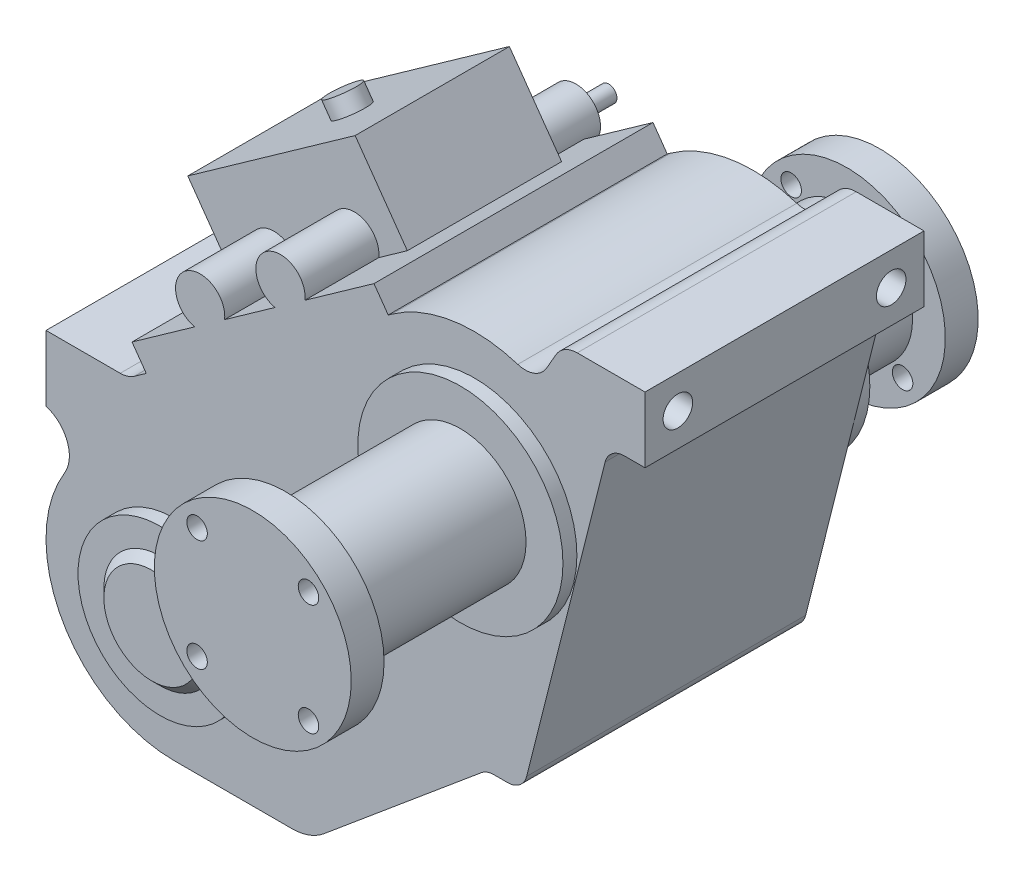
ISO-10303-21;
HEADER;
FILE_DESCRIPTION(('STEP AP214'),'2;1');
FILE_NAME('part.step','',(''),(''),'','','');
FILE_SCHEMA(('AUTOMOTIVE_DESIGN { 1 0 10303 214 1 1 1 1 }'));
ENDSEC;
DATA;
#1=APPLICATION_CONTEXT('core data for automotive mechanical design processes');
#2=APPLICATION_PROTOCOL_DEFINITION('international standard','automotive_design',2000,#1);
#3=PRODUCT_CONTEXT('',#1,'mechanical');
#4=PRODUCT('Part','Part','',(#3));
#5=PRODUCT_RELATED_PRODUCT_CATEGORY('part','',(#4));
#6=PRODUCT_DEFINITION_FORMATION('','',#4);
#7=PRODUCT_DEFINITION_CONTEXT('part definition',#1,'design');
#8=PRODUCT_DEFINITION('design','',#6,#7);
#9=PRODUCT_DEFINITION_SHAPE('','',#8);
#10=(LENGTH_UNIT() NAMED_UNIT(*) SI_UNIT(.MILLI.,.METRE.));
#11=(NAMED_UNIT(*) PLANE_ANGLE_UNIT() SI_UNIT($,.RADIAN.));
#12=(NAMED_UNIT(*) SI_UNIT($,.STERADIAN.) SOLID_ANGLE_UNIT());
#13=UNCERTAINTY_MEASURE_WITH_UNIT(LENGTH_MEASURE(1.E-05),#10,'distance_accuracy_value','');
#14=(GEOMETRIC_REPRESENTATION_CONTEXT(3) GLOBAL_UNCERTAINTY_ASSIGNED_CONTEXT((#13)) GLOBAL_UNIT_ASSIGNED_CONTEXT((#10,
#11,#12)) REPRESENTATION_CONTEXT('',''));
#15=CARTESIAN_POINT('',(0.,0.,0.));
#16=DIRECTION('',(0.,0.,1.));
#17=DIRECTION('',(1.,0.,0.));
#18=AXIS2_PLACEMENT_3D('',#15,#16,#17);
#19=CARTESIAN_POINT('',(15.9291867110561,171.79085905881,-95.));
#20=DIRECTION('',(0.,0.,1.));
#21=DIRECTION('',(1.,0.,0.));
#22=AXIS2_PLACEMENT_3D('',#19,#20,#21);
#23=PLANE('',#22);
#24=CARTESIAN_POINT('',(15.9291867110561,171.79085905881,-95.));
#25=DIRECTION('',(0.,0.,1.));
#26=DIRECTION('',(1.,0.,0.));
#27=AXIS2_PLACEMENT_3D('',#24,#25,#26);
#28=CIRCLE('',#27,15.);
#29=CARTESIAN_POINT('',(30.9291867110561,171.79085905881,-95.));
#30=VERTEX_POINT('',#29);
#31=EDGE_CURVE('E1103',#30,#30,#28,.T.);
#32=ORIENTED_EDGE('',*,*,#31,.F.);
#33=EDGE_LOOP('',(#32));
#34=FACE_BOUND('',#33,.T.);
#35=CARTESIAN_POINT('',(15.9291867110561,171.79085905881,-95.));
#36=DIRECTION('',(0.,0.,1.));
#37=DIRECTION('',(1.,0.,0.));
#38=AXIS2_PLACEMENT_3D('',#35,#36,#37);
#39=CIRCLE('',#38,5.);
#40=CARTESIAN_POINT('',(20.9291867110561,171.79085905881,-95.));
#41=VERTEX_POINT('',#40);
#42=EDGE_CURVE('E11',#41,#41,#39,.F.);
#43=ORIENTED_EDGE('',*,*,#42,.F.);
#44=EDGE_LOOP('',(#43));
#45=FACE_BOUND('',#44,.T.);
#46=ADVANCED_FACE('F41',(#34,#45),#23,.F.);
#47=CARTESIAN_POINT('',(64.8756182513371,206.493118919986,-95.));
#48=DIRECTION('',(0.,0.,1.));
#49=DIRECTION('',(1.,0.,0.));
#50=AXIS2_PLACEMENT_3D('',#47,#48,#49);
#51=PLANE('',#50);
#52=CARTESIAN_POINT('',(64.8756182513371,206.493118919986,-95.));
#53=DIRECTION('',(0.,0.,1.));
#54=DIRECTION('',(1.,0.,0.));
#55=AXIS2_PLACEMENT_3D('',#52,#53,#54);
#56=CIRCLE('',#55,15.);
#57=CARTESIAN_POINT('',(79.8756182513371,206.493118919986,-95.));
#58=VERTEX_POINT('',#57);
#59=EDGE_CURVE('E317',#58,#58,#56,.T.);
#60=ORIENTED_EDGE('',*,*,#59,.F.);
#61=EDGE_LOOP('',(#60));
#62=FACE_BOUND('',#61,.T.);
#63=CARTESIAN_POINT('',(64.8756182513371,206.493118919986,-95.));
#64=DIRECTION('',(0.,0.,1.));
#65=DIRECTION('',(1.,0.,0.));
#66=AXIS2_PLACEMENT_3D('',#63,#64,#65);
#67=CIRCLE('',#66,5.);
#68=CARTESIAN_POINT('',(69.8756182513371,206.493118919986,-95.));
#69=VERTEX_POINT('',#68);
#70=EDGE_CURVE('E49',#69,#69,#67,.F.);
#71=ORIENTED_EDGE('',*,*,#70,.F.);
#72=EDGE_LOOP('',(#71));
#73=FACE_BOUND('',#72,.T.);
#74=ADVANCED_FACE('F687',(#62,#73),#51,.F.);
#75=CARTESIAN_POINT('',(65.3615737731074,262.,-54.));
#76=DIRECTION('',(-0.578370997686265,0.815773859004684,0.));
#77=DIRECTION('',(-0.815773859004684,-0.578370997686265,0.));
#78=AXIS2_PLACEMENT_3D('',#75,#76,#77);
#79=PLANE('',#78);
#80=DIRECTION('',(-0.815773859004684,-0.578370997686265,0.));
#81=VECTOR('',#80,1.);
#82=CARTESIAN_POINT('',(65.3615737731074,262.,40.));
#83=LINE('',#82,#81);
#84=CARTESIAN_POINT('',(65.3615737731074,262.,40.));
#85=VERTEX_POINT('',#84);
#86=CARTESIAN_POINT('',(-36.6101586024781,189.703625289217,40.));
#87=VERTEX_POINT('',#86);
#88=EDGE_CURVE('E1128',#85,#87,#83,.T.);
#89=ORIENTED_EDGE('',*,*,#88,.F.);
#90=DIRECTION('',(0.,0.,1.));
#91=VECTOR('',#90,1.);
#92=CARTESIAN_POINT('',(65.3615737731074,262.,-54.));
#93=LINE('',#92,#91);
#94=CARTESIAN_POINT('',(65.3615737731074,262.,-54.));
#95=VERTEX_POINT('',#94);
#96=EDGE_CURVE('E1073',#95,#85,#93,.T.);
#97=ORIENTED_EDGE('',*,*,#96,.F.);
#98=DIRECTION('',(-0.815773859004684,-0.578370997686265,0.));
#99=VECTOR('',#98,1.);
#100=CARTESIAN_POINT('',(65.3615737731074,262.,-54.));
#101=LINE('',#100,#99);
#102=CARTESIAN_POINT('',(-36.6101586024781,189.703625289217,-54.));
#103=VERTEX_POINT('',#102);
#104=EDGE_CURVE('E1081',#95,#103,#101,.T.);
#105=ORIENTED_EDGE('',*,*,#104,.T.);
#106=DIRECTION('',(0.,0.,1.));
#107=VECTOR('',#106,1.);
#108=CARTESIAN_POINT('',(-36.6101586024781,189.703625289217,-54.));
#109=LINE('',#108,#107);
#110=EDGE_CURVE('E1072',#103,#87,#109,.T.);
#111=ORIENTED_EDGE('',*,*,#110,.T.);
#112=EDGE_LOOP('',(#89,#97,#105,#111));
#113=FACE_BOUND('',#112,.T.);
#114=CARTESIAN_POINT('',(17.7009148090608,228.209332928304,-5.83565691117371));
#115=DIRECTION('',(-0.578370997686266,0.815773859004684,0.));
#116=DIRECTION('',(-0.815773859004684,-0.578370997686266,0.));
#117=AXIS2_PLACEMENT_3D('',#114,#115,#116);
#118=CIRCLE('',#117,10.);
#119=CARTESIAN_POINT('',(9.54317621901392,222.425622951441,-5.83565691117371));
#120=VERTEX_POINT('',#119);
#121=EDGE_CURVE('E1161',#120,#120,#118,.T.);
#122=ORIENTED_EDGE('',*,*,#121,.F.);
#123=EDGE_LOOP('',(#122));
#124=FACE_BOUND('',#123,.T.);
#125=ADVANCED_FACE('F689',(#113,#124),#79,.T.);
#126=CARTESIAN_POINT('',(121.846859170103,234.626544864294,-279.94031018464));
#127=DIRECTION('',(-0.578370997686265,0.815773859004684,0.));
#128=DIRECTION('',(-0.815773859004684,-0.578370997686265,0.));
#129=AXIS2_PLACEMENT_3D('',#126,#127,#128);
#130=PLANE('',#129);
#131=DIRECTION('',(0.,0.,1.));
#132=VECTOR('',#131,1.);
#133=CARTESIAN_POINT('',(61.5386992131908,191.868995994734,-95.));
#134=LINE('',#133,#132);
#135=CARTESIAN_POINT('',(61.5386992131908,191.868995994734,40.));
#136=VERTEX_POINT('',#135);
#137=CARTESIAN_POINT('',(61.5386992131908,191.868995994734,85.));
#138=VERTEX_POINT('',#137);
#139=EDGE_CURVE('E293',#136,#138,#134,.T.);
#140=ORIENTED_EDGE('',*,*,#139,.F.);
#141=DIRECTION('',(0.815773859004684,0.578370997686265,0.));
#142=VECTOR('',#141,1.);
#143=CARTESIAN_POINT('',(-4.79975372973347,144.836063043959,40.));
#144=LINE('',#143,#142);
#145=CARTESIAN_POINT('',(30.8335257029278,170.099504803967,40.));
#146=VERTEX_POINT('',#145);
#147=EDGE_CURVE('E1125',#146,#136,#144,.T.);
#148=ORIENTED_EDGE('',*,*,#147,.F.);
#149=DIRECTION('',(0.,0.,1.));
#150=VECTOR('',#149,1.);
#151=CARTESIAN_POINT('',(30.8335257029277,170.099504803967,-95.));
#152=LINE('',#151,#150);
#153=CARTESIAN_POINT('',(30.8335257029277,170.099504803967,85.));
#154=VERTEX_POINT('',#153);
#155=EDGE_CURVE('E322',#154,#146,#152,.F.);
#156=ORIENTED_EDGE('',*,*,#155,.F.);
#157=DIRECTION('',(-0.815773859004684,-0.578370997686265,0.));
#158=VECTOR('',#157,1.);
#159=CARTESIAN_POINT('',(121.846859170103,234.626544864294,85.));
#160=LINE('',#159,#158);
#161=EDGE_CURVE('E312',#138,#154,#160,.T.);
#162=ORIENTED_EDGE('',*,*,#161,.F.);
#163=EDGE_LOOP('',(#140,#148,#156,#162));
#164=FACE_BOUND('',#163,.T.);
#165=ADVANCED_FACE('F321',(#164),#130,.T.);
#166=CARTESIAN_POINT('',(61.5386992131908,191.868995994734,-85.));
#167=VERTEX_POINT('',#166);
#168=CARTESIAN_POINT('',(61.5386992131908,191.868995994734,-54.));
#169=VERTEX_POINT('',#168);
#170=EDGE_CURVE('E64',#167,#169,#134,.T.);
#171=ORIENTED_EDGE('',*,*,#170,.F.);
#172=DIRECTION('',(0.815773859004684,0.578370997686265,0.));
#173=VECTOR('',#172,1.);
#174=CARTESIAN_POINT('',(121.846859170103,234.626544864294,-85.));
#175=LINE('',#174,#173);
#176=CARTESIAN_POINT('',(30.8335257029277,170.099504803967,-85.));
#177=VERTEX_POINT('',#176);
#178=EDGE_CURVE('E1067',#177,#167,#175,.T.);
#179=ORIENTED_EDGE('',*,*,#178,.F.);
#180=CARTESIAN_POINT('',(30.8335257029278,170.099504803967,-54.));
#181=VERTEX_POINT('',#180);
#182=EDGE_CURVE('E1111',#181,#177,#152,.F.);
#183=ORIENTED_EDGE('',*,*,#182,.F.);
#184=DIRECTION('',(0.815773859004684,0.578370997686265,0.));
#185=VECTOR('',#184,1.);
#186=CARTESIAN_POINT('',(-4.79975372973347,144.836063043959,-54.));
#187=LINE('',#186,#185);
#188=EDGE_CURVE('E1138',#181,#169,#187,.T.);
#189=ORIENTED_EDGE('',*,*,#188,.T.);
#190=EDGE_LOOP('',(#171,#179,#183,#189));
#191=FACE_BOUND('',#190,.T.);
#192=ADVANCED_FACE('F1153',(#191),#130,.T.);
#193=DIRECTION('',(0.,0.,1.));
#194=VECTOR('',#193,1.);
#195=CARTESIAN_POINT('',(12.5922676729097,157.166736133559,-95.));
#196=LINE('',#195,#194);
#197=CARTESIAN_POINT('',(12.5922676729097,157.166736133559,-85.));
#198=VERTEX_POINT('',#197);
#199=CARTESIAN_POINT('',(12.5922676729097,157.166736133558,-54.));
#200=VERTEX_POINT('',#199);
#201=EDGE_CURVE('E1114',#198,#200,#196,.T.);
#202=ORIENTED_EDGE('',*,*,#201,.F.);
#203=CARTESIAN_POINT('',(-25.5818190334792,130.101901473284,-85.));
#204=VERTEX_POINT('',#203);
#205=EDGE_CURVE('E1065',#204,#198,#175,.T.);
#206=ORIENTED_EDGE('',*,*,#205,.F.);
#207=DIRECTION('',(0.,0.,1.));
#208=VECTOR('',#207,1.);
#209=CARTESIAN_POINT('',(-25.5818190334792,130.101901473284,-279.94031018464));
#210=LINE('',#209,#208);
#211=CARTESIAN_POINT('',(-25.5818190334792,130.101901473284,85.));
#212=VERTEX_POINT('',#211);
#213=EDGE_CURVE('E330',#204,#212,#210,.T.);
#214=ORIENTED_EDGE('',*,*,#213,.T.);
#215=CARTESIAN_POINT('',(12.5922676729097,157.166736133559,85.));
#216=VERTEX_POINT('',#215);
#217=EDGE_CURVE('E323',#216,#212,#160,.T.);
#218=ORIENTED_EDGE('',*,*,#217,.F.);
#219=CARTESIAN_POINT('',(12.5922676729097,157.166736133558,40.));
#220=VERTEX_POINT('',#219);
#221=EDGE_CURVE('E1110',#220,#216,#196,.T.);
#222=ORIENTED_EDGE('',*,*,#221,.F.);
#223=CARTESIAN_POINT('',(-4.79975372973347,144.836063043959,40.));
#224=VERTEX_POINT('',#223);
#225=EDGE_CURVE('E1121',#224,#220,#144,.T.);
#226=ORIENTED_EDGE('',*,*,#225,.F.);
#227=DIRECTION('',(0.,0.,1.));
#228=VECTOR('',#227,1.);
#229=CARTESIAN_POINT('',(-4.79975372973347,144.836063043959,-54.));
#230=LINE('',#229,#228);
#231=CARTESIAN_POINT('',(-4.79975372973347,144.836063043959,-54.));
#232=VERTEX_POINT('',#231);
#233=EDGE_CURVE('E1086',#232,#224,#230,.T.);
#234=ORIENTED_EDGE('',*,*,#233,.F.);
#235=EDGE_CURVE('E1135',#232,#200,#187,.T.);
#236=ORIENTED_EDGE('',*,*,#235,.T.);
#237=EDGE_LOOP('',(#202,#206,#214,#218,#222,#226,#234,#236));
#238=FACE_BOUND('',#237,.T.);
#239=ADVANCED_FACE('F736',(#238),#130,.T.);
#240=CARTESIAN_POINT('',(-24.102323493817,112.76339211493,85.));
#241=DIRECTION('',(0.578370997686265,-0.815773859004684,0.));
#242=DIRECTION('',(0.815773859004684,0.578370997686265,0.));
#243=AXIS2_PLACEMENT_3D('',#240,#241,#242);
#244=PLANE('',#243);
#245=DIRECTION('',(-0.815773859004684,-0.578370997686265,0.));
#246=VECTOR('',#245,1.);
#247=CARTESIAN_POINT('',(-24.102323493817,112.76339211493,85.));
#248=LINE('',#247,#246);
#249=CARTESIAN_POINT('',(-16.9062540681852,117.865293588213,85.));
#250=VERTEX_POINT('',#249);
#251=CARTESIAN_POINT('',(-24.102323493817,112.76339211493,85.));
#252=VERTEX_POINT('',#251);
#253=EDGE_CURVE('E601',#250,#252,#248,.T.);
#254=ORIENTED_EDGE('',*,*,#253,.F.);
#255=DIRECTION('',(0.,0.,1.));
#256=VECTOR('',#255,1.);
#257=CARTESIAN_POINT('',(-16.9062540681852,117.865293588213,-279.94031018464));
#258=LINE('',#257,#256);
#259=CARTESIAN_POINT('',(-16.9062540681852,117.865293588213,-85.));
#260=VERTEX_POINT('',#259);
#261=EDGE_CURVE('E325',#260,#250,#258,.T.);
#262=ORIENTED_EDGE('',*,*,#261,.F.);
#263=DIRECTION('',(-0.815773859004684,-0.578370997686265,0.));
#264=VECTOR('',#263,1.);
#265=CARTESIAN_POINT('',(-24.102323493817,112.76339211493,-85.));
#266=LINE('',#265,#264);
#267=CARTESIAN_POINT('',(-24.102323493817,112.76339211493,-85.));
#268=VERTEX_POINT('',#267);
#269=EDGE_CURVE('E557',#260,#268,#266,.T.);
#270=ORIENTED_EDGE('',*,*,#269,.T.);
#271=DIRECTION('',(0.,0.,-1.));
#272=VECTOR('',#271,1.);
#273=CARTESIAN_POINT('',(-24.102323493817,112.76339211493,85.));
#274=LINE('',#273,#272);
#275=EDGE_CURVE('E610',#252,#268,#274,.T.);
#276=ORIENTED_EDGE('',*,*,#275,.F.);
#277=EDGE_LOOP('',(#254,#262,#270,#276));
#278=FACE_BOUND('',#277,.T.);
#279=ADVANCED_FACE('F876',(#278),#244,.F.);
#280=CARTESIAN_POINT('',(0.,0.,-93.5));
#281=DIRECTION('',(0.,0.,-1.));
#282=DIRECTION('',(-1.,0.,0.));
#283=AXIS2_PLACEMENT_3D('',#280,#281,#282);
#284=PLANE('',#283);
#285=CARTESIAN_POINT('',(0.,0.,-93.5));
#286=DIRECTION('',(0.,0.,-1.));
#287=DIRECTION('',(-1.,0.,0.));
#288=AXIS2_PLACEMENT_3D('',#285,#286,#287);
#289=CIRCLE('',#288,62.5);
#290=CARTESIAN_POINT('',(-62.5,0.,-93.5));
#291=VERTEX_POINT('',#290);
#292=EDGE_CURVE('E473',#291,#291,#289,.T.);
#293=ORIENTED_EDGE('',*,*,#292,.T.);
#294=EDGE_LOOP('',(#293));
#295=FACE_BOUND('',#294,.T.);
#296=CARTESIAN_POINT('',(0.,0.,-93.5));
#297=DIRECTION('',(0.,0.,-1.));
#298=DIRECTION('',(-1.,0.,0.));
#299=AXIS2_PLACEMENT_3D('',#296,#297,#298);
#300=CIRCLE('',#299,40.);
#301=CARTESIAN_POINT('',(-40.,0.,-93.5));
#302=VERTEX_POINT('',#301);
#303=EDGE_CURVE('E467',#302,#302,#300,.T.);
#304=ORIENTED_EDGE('',*,*,#303,.F.);
#305=EDGE_LOOP('',(#304));
#306=FACE_BOUND('',#305,.T.);
#307=ADVANCED_FACE('F872',(#295,#306),#284,.T.);
#308=CARTESIAN_POINT('',(-32.777888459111,125.,-85.));
#309=DIRECTION('',(0.,0.,1.));
#310=DIRECTION('',(1.,0.,0.));
#311=AXIS2_PLACEMENT_3D('',#308,#309,#310);
#312=PLANE('',#311);
#313=CARTESIAN_POINT('',(183.,152.948520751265,-85.));
#314=DIRECTION('',(0.,0.,1.));
#315=DIRECTION('',(1.,0.,0.));
#316=AXIS2_PLACEMENT_3D('',#313,#314,#315);
#317=CIRCLE('',#316,62.5);
#318=CARTESIAN_POINT('',(245.5,152.948520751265,-85.));
#319=VERTEX_POINT('',#318);
#320=EDGE_CURVE('E673',#319,#319,#317,.F.);
#321=ORIENTED_EDGE('',*,*,#320,.F.);
#322=EDGE_LOOP('',(#321));
#323=FACE_BOUND('',#322,.T.);
#324=ORIENTED_EDGE('',*,*,#178,.T.);
#325=CARTESIAN_POINT('',(64.8756182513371,206.493118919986,-85.));
#326=DIRECTION('',(0.,0.,1.));
#327=DIRECTION('',(1.,0.,0.));
#328=AXIS2_PLACEMENT_3D('',#325,#326,#327);
#329=CIRCLE('',#328,15.);
#330=CARTESIAN_POINT('',(79.7799572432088,204.801764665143,-85.));
#331=VERTEX_POINT('',#330);
#332=EDGE_CURVE('E56',#167,#331,#329,.T.);
#333=ORIENTED_EDGE('',*,*,#332,.T.);
#334=CARTESIAN_POINT('',(121.846859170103,234.626544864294,-85.));
#335=VERTEX_POINT('',#334);
#336=EDGE_CURVE('E1069',#331,#335,#175,.T.);
#337=ORIENTED_EDGE('',*,*,#336,.T.);
#338=DIRECTION('',(0.578370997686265,-0.815773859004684,0.));
#339=VECTOR('',#338,1.);
#340=CARTESIAN_POINT('',(130.522424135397,222.389936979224,-85.));
#341=LINE('',#340,#339);
#342=CARTESIAN_POINT('',(130.522424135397,222.389936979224,-85.));
#343=VERTEX_POINT('',#342);
#344=EDGE_CURVE('E333',#335,#343,#341,.T.);
#345=ORIENTED_EDGE('',*,*,#344,.T.);
#346=CARTESIAN_POINT('',(132.681723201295,223.920846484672,-85.));
#347=VERTEX_POINT('',#346);
#348=EDGE_CURVE('E558',#347,#343,#266,.T.);
#349=ORIENTED_EDGE('',*,*,#348,.F.);
#350=CARTESIAN_POINT('',(183.,152.948520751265,-85.));
#351=DIRECTION('',(0.,0.,1.));
#352=DIRECTION('',(1.,0.,0.));
#353=AXIS2_PLACEMENT_3D('',#350,#351,#352);
#354=CIRCLE('',#353,86.9999999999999);
#355=CARTESIAN_POINT('',(209.474365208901,235.822569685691,-85.));
#356=VERTEX_POINT('',#355);
#357=EDGE_CURVE('E555',#356,#347,#354,.T.);
#358=ORIENTED_EDGE('',*,*,#357,.F.);
#359=CARTESIAN_POINT('',(214.038910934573,250.111198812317,-85.));
#360=DIRECTION('',(0.,0.,-1.));
#361=DIRECTION('',(-1.,0.,0.));
#362=AXIS2_PLACEMENT_3D('',#359,#360,#361);
#363=CIRCLE('',#362,14.9999999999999);
#364=CARTESIAN_POINT('',(227.051527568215,242.649844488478,-85.));
#365=VERTEX_POINT('',#364);
#366=EDGE_CURVE('E553',#365,#356,#363,.T.);
#367=ORIENTED_EDGE('',*,*,#366,.F.);
#368=DIRECTION('',(-0.497423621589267,-0.867507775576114,0.));
#369=VECTOR('',#368,1.);
#370=CARTESIAN_POINT('',(232.677386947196,252.461354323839,-85.));
#371=LINE('',#370,#369);
#372=CARTESIAN_POINT('',(232.677386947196,252.461354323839,-85.));
#373=VERTEX_POINT('',#372);
#374=EDGE_CURVE('E551',#373,#365,#371,.T.);
#375=ORIENTED_EDGE('',*,*,#374,.F.);
#376=CARTESIAN_POINT('',(245.690003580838,245.,-85.));
#377=DIRECTION('',(0.,0.,1.));
#378=DIRECTION('',(1.,0.,0.));
#379=AXIS2_PLACEMENT_3D('',#376,#377,#378);
#380=CIRCLE('',#379,15.0000000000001);
#381=CARTESIAN_POINT('',(245.690003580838,260.,-85.));
#382=VERTEX_POINT('',#381);
#383=EDGE_CURVE('E549',#382,#373,#380,.T.);
#384=ORIENTED_EDGE('',*,*,#383,.F.);
#385=DIRECTION('',(-1.,0.,0.));
#386=VECTOR('',#385,1.);
#387=CARTESIAN_POINT('',(287.,260.,-85.));
#388=LINE('',#387,#386);
#389=CARTESIAN_POINT('',(287.,260.,-85.));
#390=VERTEX_POINT('',#389);
#391=EDGE_CURVE('E547',#390,#382,#388,.T.);
#392=ORIENTED_EDGE('',*,*,#391,.F.);
#393=DIRECTION('',(0.,1.,0.));
#394=VECTOR('',#393,1.);
#395=CARTESIAN_POINT('',(287.,260.,-85.));
#396=LINE('',#395,#394);
#397=CARTESIAN_POINT('',(287.,220.,-85.));
#398=VERTEX_POINT('',#397);
#399=EDGE_CURVE('E545',#398,#390,#396,.T.);
#400=ORIENTED_EDGE('',*,*,#399,.F.);
#401=DIRECTION('',(1.,0.,0.));
#402=VECTOR('',#401,1.);
#403=CARTESIAN_POINT('',(287.,220.,-85.));
#404=LINE('',#403,#402);
#405=CARTESIAN_POINT('',(274.350292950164,220.,-85.));
#406=VERTEX_POINT('',#405);
#407=EDGE_CURVE('E543',#406,#398,#404,.T.);
#408=ORIENTED_EDGE('',*,*,#407,.F.);
#409=CARTESIAN_POINT('',(274.350292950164,208.,-85.));
#410=DIRECTION('',(0.,0.,-1.));
#411=DIRECTION('',(1.,0.,0.));
#412=AXIS2_PLACEMENT_3D('',#409,#410,#411);
#413=CIRCLE('',#412,12.);
#414=CARTESIAN_POINT('',(262.714343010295,210.933371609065,-85.));
#415=VERTEX_POINT('',#414);
#416=EDGE_CURVE('E541',#415,#406,#413,.T.);
#417=ORIENTED_EDGE('',*,*,#416,.F.);
#418=DIRECTION('',(0.244447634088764,0.969662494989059,0.));
#419=VECTOR('',#418,1.);
#420=CARTESIAN_POINT('',(214.849775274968,21.0666283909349,-85.));
#421=LINE('',#420,#419);
#422=CARTESIAN_POINT('',(214.849775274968,21.0666283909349,-85.));
#423=VERTEX_POINT('',#422);
#424=EDGE_CURVE('E539',#423,#415,#421,.T.);
#425=ORIENTED_EDGE('',*,*,#424,.F.);
#426=CARTESIAN_POINT('',(203.213825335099,24.,-85.));
#427=DIRECTION('',(0.,0.,1.));
#428=DIRECTION('',(1.,0.,0.));
#429=AXIS2_PLACEMENT_3D('',#426,#427,#428);
#430=CIRCLE('',#429,12.);
#431=CARTESIAN_POINT('',(203.213825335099,12.,-85.));
#432=VERTEX_POINT('',#431);
#433=EDGE_CURVE('E537',#432,#423,#430,.T.);
#434=ORIENTED_EDGE('',*,*,#433,.F.);
#435=DIRECTION('',(1.,0.,0.));
#436=VECTOR('',#435,1.);
#437=CARTESIAN_POINT('',(194.918524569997,12.,-85.));
#438=LINE('',#437,#436);
#439=CARTESIAN_POINT('',(194.918524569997,12.,-85.));
#440=VERTEX_POINT('',#439);
#441=EDGE_CURVE('E535',#440,#432,#438,.T.);
#442=ORIENTED_EDGE('',*,*,#441,.F.);
#443=CARTESIAN_POINT('',(194.918524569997,0.,-85.));
#444=DIRECTION('',(0.,0.,-1.));
#445=DIRECTION('',(-1.,0.,0.));
#446=AXIS2_PLACEMENT_3D('',#443,#444,#445);
#447=CIRCLE('',#446,12.);
#448=CARTESIAN_POINT('',(187.223001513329,9.20754716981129,-85.));
#449=VERTEX_POINT('',#448);
#450=EDGE_CURVE('E533',#449,#440,#447,.T.);
#451=ORIENTED_EDGE('',*,*,#450,.F.);
#452=DIRECTION('',(0.767295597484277,0.641293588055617,0.));
#453=VECTOR('',#452,1.);
#454=CARTESIAN_POINT('',(91.2336196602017,-71.0188679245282,-85.));
#455=LINE('',#454,#453);
#456=CARTESIAN_POINT('',(91.2336196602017,-71.0188679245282,-85.));
#457=VERTEX_POINT('',#456);
#458=EDGE_CURVE('E531',#457,#449,#455,.T.);
#459=ORIENTED_EDGE('',*,*,#458,.F.);
#460=CARTESIAN_POINT('',(71.9948120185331,-48.,-85.));
#461=DIRECTION('',(0.,0.,1.));
#462=DIRECTION('',(1.,0.,0.));
#463=AXIS2_PLACEMENT_3D('',#460,#461,#462);
#464=CIRCLE('',#463,30.);
#465=CARTESIAN_POINT('',(71.994812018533,-78.,-85.));
#466=VERTEX_POINT('',#465);
#467=EDGE_CURVE('E529',#466,#457,#464,.T.);
#468=ORIENTED_EDGE('',*,*,#467,.F.);
#469=DIRECTION('',(1.,0.,0.));
#470=VECTOR('',#469,1.);
#471=CARTESIAN_POINT('',(0.,-78.,-85.));
#472=LINE('',#471,#470);
#473=CARTESIAN_POINT('',(0.,-78.,-85.));
#474=VERTEX_POINT('',#473);
#475=EDGE_CURVE('E527',#474,#466,#472,.T.);
#476=ORIENTED_EDGE('',*,*,#475,.F.);
#477=CARTESIAN_POINT('',(0.,0.,-85.));
#478=DIRECTION('',(0.,0.,1.));
#479=DIRECTION('',(1.,0.,0.));
#480=AXIS2_PLACEMENT_3D('',#477,#478,#479);
#481=CIRCLE('',#480,78.);
#482=CARTESIAN_POINT('',(-66.677389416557,40.4737660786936,-85.));
#483=VERTEX_POINT('',#482);
#484=EDGE_CURVE('E525',#483,#474,#481,.T.);
#485=ORIENTED_EDGE('',*,*,#484,.F.);
#486=CARTESIAN_POINT('',(-83.7741559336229,50.8516548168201,-85.));
#487=DIRECTION('',(0.,0.,-1.));
#488=DIRECTION('',(-1.,0.,0.));
#489=AXIS2_PLACEMENT_3D('',#486,#487,#488);
#490=CIRCLE('',#489,20.);
#491=CARTESIAN_POINT('',(-78.,70.,-85.));
#492=VERTEX_POINT('',#491);
#493=EDGE_CURVE('E523',#492,#483,#490,.T.);
#494=ORIENTED_EDGE('',*,*,#493,.F.);
#495=DIRECTION('',(0.,-1.,0.));
#496=VECTOR('',#495,1.);
#497=CARTESIAN_POINT('',(-78.,110.,-85.));
#498=LINE('',#497,#496);
#499=CARTESIAN_POINT('',(-78.,110.,-85.));
#500=VERTEX_POINT('',#499);
#501=EDGE_CURVE('E521',#500,#492,#498,.T.);
#502=ORIENTED_EDGE('',*,*,#501,.F.);
#503=DIRECTION('',(-1.,0.,0.));
#504=VECTOR('',#503,1.);
#505=CARTESIAN_POINT('',(-78.,110.,-85.));
#506=LINE('',#505,#504);
#507=CARTESIAN_POINT('',(-32.7778884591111,110.,-85.));
#508=VERTEX_POINT('',#507);
#509=EDGE_CURVE('E518',#508,#500,#506,.T.);
#510=ORIENTED_EDGE('',*,*,#509,.F.);
#511=CARTESIAN_POINT('',(-32.777888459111,125.,-85.));
#512=DIRECTION('',(0.,0.,-1.));
#513=DIRECTION('',(1.,0.,0.));
#514=AXIS2_PLACEMENT_3D('',#511,#512,#513);
#515=CIRCLE('',#514,15.);
#516=EDGE_CURVE('E560',#268,#508,#515,.T.);
#517=ORIENTED_EDGE('',*,*,#516,.F.);
#518=ORIENTED_EDGE('',*,*,#269,.F.);
#519=DIRECTION('',(-0.578370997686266,0.815773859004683,0.));
#520=VECTOR('',#519,1.);
#521=CARTESIAN_POINT('',(-25.5818190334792,130.101901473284,-85.));
#522=LINE('',#521,#520);
#523=EDGE_CURVE('E344',#260,#204,#522,.T.);
#524=ORIENTED_EDGE('',*,*,#523,.T.);
#525=ORIENTED_EDGE('',*,*,#205,.T.);
#526=CARTESIAN_POINT('',(15.9291867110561,171.79085905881,-85.));
#527=DIRECTION('',(0.,0.,1.));
#528=DIRECTION('',(1.,0.,0.));
#529=AXIS2_PLACEMENT_3D('',#526,#527,#528);
#530=CIRCLE('',#529,15.);
#531=EDGE_CURVE('E1093',#198,#177,#530,.T.);
#532=ORIENTED_EDGE('',*,*,#531,.T.);
#533=EDGE_LOOP('',(#324,#333,#337,#345,#349,#358,#367,#375,#384,#392,#400,#408,#417,#425,#434,
#442,#451,#459,#468,#476,#485,#494,#502,#510,#517,#518,#524,#525,#532));
#534=FACE_BOUND('',#533,.T.);
#535=CARTESIAN_POINT('',(0.,0.,-85.));
#536=DIRECTION('',(0.,0.,1.));
#537=DIRECTION('',(1.,0.,0.));
#538=AXIS2_PLACEMENT_3D('',#535,#536,#537);
#539=CIRCLE('',#538,62.5);
#540=CARTESIAN_POINT('',(62.5,0.,-85.));
#541=VERTEX_POINT('',#540);
#542=EDGE_CURVE('E676',#541,#541,#539,.F.);
#543=ORIENTED_EDGE('',*,*,#542,.F.);
#544=EDGE_LOOP('',(#543));
#545=FACE_BOUND('',#544,.T.);
#546=ADVANCED_FACE('F875',(#323,#534,#545),#312,.F.);
#547=CARTESIAN_POINT('',(183.,152.948520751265,-93.5));
#548=DIRECTION('',(0.,0.,-1.));
#549=DIRECTION('',(-1.,0.,0.));
#550=AXIS2_PLACEMENT_3D('',#547,#548,#549);
#551=PLANE('',#550);
#552=CARTESIAN_POINT('',(183.,152.948520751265,-93.5));
#553=DIRECTION('',(0.,0.,-1.));
#554=DIRECTION('',(-1.,0.,0.));
#555=AXIS2_PLACEMENT_3D('',#552,#553,#554);
#556=CIRCLE('',#555,62.5);
#557=CARTESIAN_POINT('',(120.5,152.948520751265,-93.5));
#558=VERTEX_POINT('',#557);
#559=EDGE_CURVE('E488',#558,#558,#556,.T.);
#560=ORIENTED_EDGE('',*,*,#559,.T.);
#561=EDGE_LOOP('',(#560));
#562=FACE_BOUND('',#561,.T.);
#563=CARTESIAN_POINT('',(183.,152.948520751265,-93.5));
#564=DIRECTION('',(0.,0.,-1.));
#565=DIRECTION('',(-1.,0.,0.));
#566=AXIS2_PLACEMENT_3D('',#563,#564,#565);
#567=CIRCLE('',#566,40.);
#568=CARTESIAN_POINT('',(223.,152.948520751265,-93.5));
#569=VERTEX_POINT('',#568);
#570=EDGE_CURVE('E482',#569,#569,#567,.T.);
#571=ORIENTED_EDGE('',*,*,#570,.F.);
#572=EDGE_LOOP('',(#571));
#573=FACE_BOUND('',#572,.T.);
#574=ADVANCED_FACE('F898',(#562,#573),#551,.T.);
#575=CARTESIAN_POINT('',(0.,0.,93.5));
#576=DIRECTION('',(0.,0.,1.));
#577=DIRECTION('',(1.,0.,0.));
#578=AXIS2_PLACEMENT_3D('',#575,#576,#577);
#579=PLANE('',#578);
#580=CARTESIAN_POINT('',(0.,0.,93.5));
#581=DIRECTION('',(0.,0.,1.));
#582=DIRECTION('',(1.,0.,0.));
#583=AXIS2_PLACEMENT_3D('',#580,#581,#582);
#584=CIRCLE('',#583,50.);
#585=CARTESIAN_POINT('',(50.,0.,93.5));
#586=VERTEX_POINT('',#585);
#587=EDGE_CURVE('E497',#586,#586,#584,.T.);
#588=ORIENTED_EDGE('',*,*,#587,.T.);
#589=EDGE_LOOP('',(#588));
#590=FACE_BOUND('',#589,.T.);
#591=CARTESIAN_POINT('',(0.,0.,93.5));
#592=DIRECTION('',(0.,0.,1.));
#593=DIRECTION('',(1.,0.,0.));
#594=AXIS2_PLACEMENT_3D('',#591,#592,#593);
#595=CIRCLE('',#594,34.2468035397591);
#596=CARTESIAN_POINT('',(34.2468035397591,0.,93.5));
#597=VERTEX_POINT('',#596);
#598=EDGE_CURVE('E491',#597,#597,#595,.T.);
#599=ORIENTED_EDGE('',*,*,#598,.F.);
#600=EDGE_LOOP('',(#599));
#601=FACE_BOUND('',#600,.T.);
#602=ADVANCED_FACE('F901',(#590,#601),#579,.T.);
#603=CARTESIAN_POINT('',(-32.777888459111,125.,85.));
#604=DIRECTION('',(0.,0.,1.));
#605=DIRECTION('',(1.,0.,0.));
#606=AXIS2_PLACEMENT_3D('',#603,#604,#605);
#607=PLANE('',#606);
#608=CARTESIAN_POINT('',(121.846859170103,234.626544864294,85.));
#609=VERTEX_POINT('',#608);
#610=CARTESIAN_POINT('',(79.7799572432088,204.801764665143,85.));
#611=VERTEX_POINT('',#610);
#612=EDGE_CURVE('E316',#609,#611,#160,.T.);
#613=ORIENTED_EDGE('',*,*,#612,.T.);
#614=CARTESIAN_POINT('',(64.8756182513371,206.493118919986,85.));
#615=DIRECTION('',(0.,0.,1.));
#616=DIRECTION('',(1.,0.,0.));
#617=AXIS2_PLACEMENT_3D('',#614,#615,#616);
#618=CIRCLE('',#617,15.);
#619=EDGE_CURVE('E296',#611,#138,#618,.T.);
#620=ORIENTED_EDGE('',*,*,#619,.T.);
#621=ORIENTED_EDGE('',*,*,#161,.T.);
#622=CARTESIAN_POINT('',(15.9291867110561,171.79085905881,85.));
#623=DIRECTION('',(0.,0.,1.));
#624=DIRECTION('',(1.,0.,0.));
#625=AXIS2_PLACEMENT_3D('',#622,#623,#624);
#626=CIRCLE('',#625,15.);
#627=EDGE_CURVE('E1101',#154,#216,#626,.T.);
#628=ORIENTED_EDGE('',*,*,#627,.T.);
#629=ORIENTED_EDGE('',*,*,#217,.T.);
#630=DIRECTION('',(0.578370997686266,-0.815773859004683,0.));
#631=VECTOR('',#630,1.);
#632=CARTESIAN_POINT('',(-25.5818190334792,130.101901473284,85.));
#633=LINE('',#632,#631);
#634=EDGE_CURVE('E1071',#212,#250,#633,.T.);
#635=ORIENTED_EDGE('',*,*,#634,.T.);
#636=ORIENTED_EDGE('',*,*,#253,.T.);
#637=CARTESIAN_POINT('',(-32.777888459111,125.,85.));
#638=DIRECTION('',(0.,0.,-1.));
#639=DIRECTION('',(1.,0.,0.));
#640=AXIS2_PLACEMENT_3D('',#637,#638,#639);
#641=CIRCLE('',#640,15.);
#642=CARTESIAN_POINT('',(-32.7778884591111,110.,85.));
#643=VERTEX_POINT('',#642);
#644=EDGE_CURVE('E605',#252,#643,#641,.T.);
#645=ORIENTED_EDGE('',*,*,#644,.T.);
#646=DIRECTION('',(-1.,0.,0.));
#647=VECTOR('',#646,1.);
#648=CARTESIAN_POINT('',(-78.,110.,85.));
#649=LINE('',#648,#647);
#650=CARTESIAN_POINT('',(-78.,110.,85.));
#651=VERTEX_POINT('',#650);
#652=EDGE_CURVE('E562',#643,#651,#649,.T.);
#653=ORIENTED_EDGE('',*,*,#652,.T.);
#654=DIRECTION('',(0.,-1.,0.));
#655=VECTOR('',#654,1.);
#656=CARTESIAN_POINT('',(-78.,110.,85.));
#657=LINE('',#656,#655);
#658=CARTESIAN_POINT('',(-78.,70.,85.));
#659=VERTEX_POINT('',#658);
#660=EDGE_CURVE('E565',#651,#659,#657,.T.);
#661=ORIENTED_EDGE('',*,*,#660,.T.);
#662=CARTESIAN_POINT('',(-83.7741559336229,50.8516548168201,85.));
#663=DIRECTION('',(0.,0.,-1.));
#664=DIRECTION('',(-1.,0.,0.));
#665=AXIS2_PLACEMENT_3D('',#662,#663,#664);
#666=CIRCLE('',#665,20.);
#667=CARTESIAN_POINT('',(-66.677389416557,40.4737660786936,85.));
#668=VERTEX_POINT('',#667);
#669=EDGE_CURVE('E567',#659,#668,#666,.T.);
#670=ORIENTED_EDGE('',*,*,#669,.T.);
#671=CARTESIAN_POINT('',(0.,0.,85.));
#672=DIRECTION('',(0.,0.,1.));
#673=DIRECTION('',(1.,0.,0.));
#674=AXIS2_PLACEMENT_3D('',#671,#672,#673);
#675=CIRCLE('',#674,78.);
#676=CARTESIAN_POINT('',(0.,-78.,85.));
#677=VERTEX_POINT('',#676);
#678=EDGE_CURVE('E569',#668,#677,#675,.T.);
#679=ORIENTED_EDGE('',*,*,#678,.T.);
#680=DIRECTION('',(1.,0.,0.));
#681=VECTOR('',#680,1.);
#682=CARTESIAN_POINT('',(0.,-78.,85.));
#683=LINE('',#682,#681);
#684=CARTESIAN_POINT('',(71.994812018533,-78.,85.));
#685=VERTEX_POINT('',#684);
#686=EDGE_CURVE('E571',#677,#685,#683,.T.);
#687=ORIENTED_EDGE('',*,*,#686,.T.);
#688=CARTESIAN_POINT('',(71.9948120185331,-48.,85.));
#689=DIRECTION('',(0.,0.,1.));
#690=DIRECTION('',(1.,0.,0.));
#691=AXIS2_PLACEMENT_3D('',#688,#689,#690);
#692=CIRCLE('',#691,30.);
#693=CARTESIAN_POINT('',(91.2336196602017,-71.0188679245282,85.));
#694=VERTEX_POINT('',#693);
#695=EDGE_CURVE('E573',#685,#694,#692,.T.);
#696=ORIENTED_EDGE('',*,*,#695,.T.);
#697=DIRECTION('',(0.767295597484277,0.641293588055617,0.));
#698=VECTOR('',#697,1.);
#699=CARTESIAN_POINT('',(91.2336196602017,-71.0188679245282,85.));
#700=LINE('',#699,#698);
#701=CARTESIAN_POINT('',(187.223001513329,9.20754716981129,85.));
#702=VERTEX_POINT('',#701);
#703=EDGE_CURVE('E575',#694,#702,#700,.T.);
#704=ORIENTED_EDGE('',*,*,#703,.T.);
#705=CARTESIAN_POINT('',(194.918524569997,0.,85.));
#706=DIRECTION('',(0.,0.,-1.));
#707=DIRECTION('',(-1.,0.,0.));
#708=AXIS2_PLACEMENT_3D('',#705,#706,#707);
#709=CIRCLE('',#708,12.);
#710=CARTESIAN_POINT('',(194.918524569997,12.,85.));
#711=VERTEX_POINT('',#710);
#712=EDGE_CURVE('E577',#702,#711,#709,.T.);
#713=ORIENTED_EDGE('',*,*,#712,.T.);
#714=DIRECTION('',(1.,0.,0.));
#715=VECTOR('',#714,1.);
#716=CARTESIAN_POINT('',(194.918524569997,12.,85.));
#717=LINE('',#716,#715);
#718=CARTESIAN_POINT('',(203.213825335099,12.,85.));
#719=VERTEX_POINT('',#718);
#720=EDGE_CURVE('E579',#711,#719,#717,.T.);
#721=ORIENTED_EDGE('',*,*,#720,.T.);
#722=CARTESIAN_POINT('',(203.213825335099,24.,85.));
#723=DIRECTION('',(0.,0.,1.));
#724=DIRECTION('',(1.,0.,0.));
#725=AXIS2_PLACEMENT_3D('',#722,#723,#724);
#726=CIRCLE('',#725,12.);
#727=CARTESIAN_POINT('',(214.849775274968,21.0666283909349,85.));
#728=VERTEX_POINT('',#727);
#729=EDGE_CURVE('E581',#719,#728,#726,.T.);
#730=ORIENTED_EDGE('',*,*,#729,.T.);
#731=DIRECTION('',(0.244447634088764,0.969662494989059,0.));
#732=VECTOR('',#731,1.);
#733=CARTESIAN_POINT('',(214.849775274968,21.0666283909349,85.));
#734=LINE('',#733,#732);
#735=CARTESIAN_POINT('',(262.714343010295,210.933371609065,85.));
#736=VERTEX_POINT('',#735);
#737=EDGE_CURVE('E583',#728,#736,#734,.T.);
#738=ORIENTED_EDGE('',*,*,#737,.T.);
#739=CARTESIAN_POINT('',(274.350292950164,208.,85.));
#740=DIRECTION('',(0.,0.,-1.));
#741=DIRECTION('',(1.,0.,0.));
#742=AXIS2_PLACEMENT_3D('',#739,#740,#741);
#743=CIRCLE('',#742,12.);
#744=CARTESIAN_POINT('',(274.350292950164,220.,85.));
#745=VERTEX_POINT('',#744);
#746=EDGE_CURVE('E585',#736,#745,#743,.T.);
#747=ORIENTED_EDGE('',*,*,#746,.T.);
#748=DIRECTION('',(1.,0.,0.));
#749=VECTOR('',#748,1.);
#750=CARTESIAN_POINT('',(287.,220.,85.));
#751=LINE('',#750,#749);
#752=CARTESIAN_POINT('',(287.,220.,85.));
#753=VERTEX_POINT('',#752);
#754=EDGE_CURVE('E587',#745,#753,#751,.T.);
#755=ORIENTED_EDGE('',*,*,#754,.T.);
#756=DIRECTION('',(0.,1.,0.));
#757=VECTOR('',#756,1.);
#758=CARTESIAN_POINT('',(287.,260.,85.));
#759=LINE('',#758,#757);
#760=CARTESIAN_POINT('',(287.,260.,85.));
#761=VERTEX_POINT('',#760);
#762=EDGE_CURVE('E589',#753,#761,#759,.T.);
#763=ORIENTED_EDGE('',*,*,#762,.T.);
#764=DIRECTION('',(-1.,0.,0.));
#765=VECTOR('',#764,1.);
#766=CARTESIAN_POINT('',(287.,260.,85.));
#767=LINE('',#766,#765);
#768=CARTESIAN_POINT('',(245.690003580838,260.,85.));
#769=VERTEX_POINT('',#768);
#770=EDGE_CURVE('E591',#761,#769,#767,.T.);
#771=ORIENTED_EDGE('',*,*,#770,.T.);
#772=CARTESIAN_POINT('',(245.690003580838,245.,85.));
#773=DIRECTION('',(0.,0.,1.));
#774=DIRECTION('',(1.,0.,0.));
#775=AXIS2_PLACEMENT_3D('',#772,#773,#774);
#776=CIRCLE('',#775,15.0000000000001);
#777=CARTESIAN_POINT('',(232.677386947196,252.461354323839,85.));
#778=VERTEX_POINT('',#777);
#779=EDGE_CURVE('E593',#769,#778,#776,.T.);
#780=ORIENTED_EDGE('',*,*,#779,.T.);
#781=DIRECTION('',(-0.497423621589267,-0.867507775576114,0.));
#782=VECTOR('',#781,1.);
#783=CARTESIAN_POINT('',(232.677386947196,252.461354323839,85.));
#784=LINE('',#783,#782);
#785=CARTESIAN_POINT('',(227.051527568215,242.649844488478,85.));
#786=VERTEX_POINT('',#785);
#787=EDGE_CURVE('E595',#778,#786,#784,.T.);
#788=ORIENTED_EDGE('',*,*,#787,.T.);
#789=CARTESIAN_POINT('',(214.038910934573,250.111198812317,85.));
#790=DIRECTION('',(0.,0.,-1.));
#791=DIRECTION('',(-1.,0.,0.));
#792=AXIS2_PLACEMENT_3D('',#789,#790,#791);
#793=CIRCLE('',#792,14.9999999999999);
#794=CARTESIAN_POINT('',(209.474365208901,235.822569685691,85.));
#795=VERTEX_POINT('',#794);
#796=EDGE_CURVE('E597',#786,#795,#793,.T.);
#797=ORIENTED_EDGE('',*,*,#796,.T.);
#798=CARTESIAN_POINT('',(183.,152.948520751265,85.));
#799=DIRECTION('',(0.,0.,1.));
#800=DIRECTION('',(1.,0.,0.));
#801=AXIS2_PLACEMENT_3D('',#798,#799,#800);
#802=CIRCLE('',#801,86.9999999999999);
#803=CARTESIAN_POINT('',(132.681723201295,223.920846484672,85.));
#804=VERTEX_POINT('',#803);
#805=EDGE_CURVE('E599',#795,#804,#802,.T.);
#806=ORIENTED_EDGE('',*,*,#805,.T.);
#807=CARTESIAN_POINT('',(130.522424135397,222.389936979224,85.));
#808=VERTEX_POINT('',#807);
#809=EDGE_CURVE('E602',#804,#808,#248,.T.);
#810=ORIENTED_EDGE('',*,*,#809,.T.);
#811=DIRECTION('',(-0.578370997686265,0.815773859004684,0.));
#812=VECTOR('',#811,1.);
#813=CARTESIAN_POINT('',(130.522424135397,222.389936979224,85.));
#814=LINE('',#813,#812);
#815=EDGE_CURVE('E326',#808,#609,#814,.T.);
#816=ORIENTED_EDGE('',*,*,#815,.T.);
#817=EDGE_LOOP('',(#613,#620,#621,#628,#629,#635,#636,#645,#653,#661,#670,#679,#687,#696,#704,
#713,#721,#730,#738,#747,#755,#763,#771,#780,#788,#797,#806,#810,#816));
#818=FACE_BOUND('',#817,.T.);
#819=CARTESIAN_POINT('',(183.,152.948520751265,85.));
#820=DIRECTION('',(0.,0.,1.));
#821=DIRECTION('',(1.,0.,0.));
#822=AXIS2_PLACEMENT_3D('',#819,#820,#821);
#823=CIRCLE('',#822,62.5);
#824=CARTESIAN_POINT('',(245.5,152.948520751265,85.));
#825=VERTEX_POINT('',#824);
#826=EDGE_CURVE('E512',#825,#825,#823,.T.);
#827=ORIENTED_EDGE('',*,*,#826,.F.);
#828=EDGE_LOOP('',(#827));
#829=FACE_BOUND('',#828,.T.);
#830=CARTESIAN_POINT('',(0.,0.,85.));
#831=DIRECTION('',(0.,0.,1.));
#832=DIRECTION('',(1.,0.,0.));
#833=AXIS2_PLACEMENT_3D('',#830,#831,#832);
#834=CIRCLE('',#833,50.);
#835=CARTESIAN_POINT('',(50.,0.,85.));
#836=VERTEX_POINT('',#835);
#837=EDGE_CURVE('E494',#836,#836,#834,.T.);
#838=ORIENTED_EDGE('',*,*,#837,.F.);
#839=EDGE_LOOP('',(#838));
#840=FACE_BOUND('',#839,.T.);
#841=ADVANCED_FACE('F309',(#818,#829,#840),#607,.T.);
#842=CARTESIAN_POINT('',(183.,152.948520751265,93.5));
#843=DIRECTION('',(0.,0.,1.));
#844=DIRECTION('',(1.,0.,0.));
#845=AXIS2_PLACEMENT_3D('',#842,#843,#844);
#846=PLANE('',#845);
#847=CARTESIAN_POINT('',(183.,152.948520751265,93.5));
#848=DIRECTION('',(0.,0.,1.));
#849=DIRECTION('',(1.,0.,0.));
#850=AXIS2_PLACEMENT_3D('',#847,#848,#849);
#851=CIRCLE('',#850,62.5);
#852=CARTESIAN_POINT('',(245.5,152.948520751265,93.5));
#853=VERTEX_POINT('',#852);
#854=EDGE_CURVE('E515',#853,#853,#851,.T.);
#855=ORIENTED_EDGE('',*,*,#854,.T.);
#856=EDGE_LOOP('',(#855));
#857=FACE_BOUND('',#856,.T.);
#858=CARTESIAN_POINT('',(183.,152.948520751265,93.5));
#859=DIRECTION('',(0.,0.,1.));
#860=DIRECTION('',(1.,0.,0.));
#861=AXIS2_PLACEMENT_3D('',#858,#859,#860);
#862=CIRCLE('',#861,40.);
#863=CARTESIAN_POINT('',(223.,152.948520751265,93.5));
#864=VERTEX_POINT('',#863);
#865=EDGE_CURVE('E506',#864,#864,#862,.T.);
#866=ORIENTED_EDGE('',*,*,#865,.F.);
#867=EDGE_LOOP('',(#866));
#868=FACE_BOUND('',#867,.T.);
#869=ADVANCED_FACE('F938',(#857,#868),#846,.T.);
#870=CARTESIAN_POINT('',(-78.,110.,85.));
#871=DIRECTION('',(0.,-1.,0.));
#872=DIRECTION('',(0.,0.,-1.));
#873=AXIS2_PLACEMENT_3D('',#870,#871,#872);
#874=PLANE('',#873);
#875=ORIENTED_EDGE('',*,*,#509,.T.);
#876=DIRECTION('',(0.,0.,-1.));
#877=VECTOR('',#876,1.);
#878=CARTESIAN_POINT('',(-78.,110.,85.));
#879=LINE('',#878,#877);
#880=EDGE_CURVE('E667',#651,#500,#879,.T.);
#881=ORIENTED_EDGE('',*,*,#880,.F.);
#882=ORIENTED_EDGE('',*,*,#652,.F.);
#883=DIRECTION('',(0.,0.,-1.));
#884=VECTOR('',#883,1.);
#885=CARTESIAN_POINT('',(-32.7778884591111,110.,85.));
#886=LINE('',#885,#884);
#887=EDGE_CURVE('E607',#643,#508,#886,.T.);
#888=ORIENTED_EDGE('',*,*,#887,.T.);
#889=EDGE_LOOP('',(#875,#881,#882,#888));
#890=FACE_BOUND('',#889,.T.);
#891=ADVANCED_FACE('F43',(#890),#874,.F.);
#892=CARTESIAN_POINT('',(-78.,110.,85.));
#893=DIRECTION('',(1.,0.,0.));
#894=DIRECTION('',(0.,1.,0.));
#895=AXIS2_PLACEMENT_3D('',#892,#893,#894);
#896=PLANE('',#895);
#897=CARTESIAN_POINT('',(-78.,90.,-65.));
#898=DIRECTION('',(-1.,0.,0.));
#899=DIRECTION('',(0.,0.,1.));
#900=AXIS2_PLACEMENT_3D('',#897,#898,#899);
#901=CIRCLE('',#900,8.99999999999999);
#902=CARTESIAN_POINT('',(-78.,90.,-56.));
#903=VERTEX_POINT('',#902);
#904=EDGE_CURVE('E446',#903,#903,#901,.T.);
#905=ORIENTED_EDGE('',*,*,#904,.F.);
#906=EDGE_LOOP('',(#905));
#907=FACE_BOUND('',#906,.T.);
#908=CARTESIAN_POINT('',(-78.,90.,65.));
#909=DIRECTION('',(-1.,0.,0.));
#910=DIRECTION('',(0.,0.,1.));
#911=AXIS2_PLACEMENT_3D('',#908,#909,#910);
#912=CIRCLE('',#911,8.99999999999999);
#913=CARTESIAN_POINT('',(-78.,90.,74.));
#914=VERTEX_POINT('',#913);
#915=EDGE_CURVE('E458',#914,#914,#912,.T.);
#916=ORIENTED_EDGE('',*,*,#915,.F.);
#917=EDGE_LOOP('',(#916));
#918=FACE_BOUND('',#917,.T.);
#919=ORIENTED_EDGE('',*,*,#501,.T.);
#920=DIRECTION('',(0.,0.,-1.));
#921=VECTOR('',#920,1.);
#922=CARTESIAN_POINT('',(-78.,70.,85.));
#923=LINE('',#922,#921);
#924=EDGE_CURVE('E664',#659,#492,#923,.T.);
#925=ORIENTED_EDGE('',*,*,#924,.F.);
#926=ORIENTED_EDGE('',*,*,#660,.F.);
#927=ORIENTED_EDGE('',*,*,#880,.T.);
#928=EDGE_LOOP('',(#919,#925,#926,#927));
#929=FACE_BOUND('',#928,.T.);
#930=ADVANCED_FACE('F1024',(#907,#918,#929),#896,.F.);
#931=CARTESIAN_POINT('',(-83.7741559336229,50.8516548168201,85.));
#932=DIRECTION('',(0.,0.,-1.));
#933=DIRECTION('',(-1.,0.,0.));
#934=AXIS2_PLACEMENT_3D('',#931,#932,#933);
#935=CYLINDRICAL_SURFACE('',#934,20.);
#936=ORIENTED_EDGE('',*,*,#493,.T.);
#937=DIRECTION('',(0.,0.,-1.));
#938=VECTOR('',#937,1.);
#939=CARTESIAN_POINT('',(-66.677389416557,40.4737660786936,85.));
#940=LINE('',#939,#938);
#941=EDGE_CURVE('E661',#668,#483,#940,.T.);
#942=ORIENTED_EDGE('',*,*,#941,.F.);
#943=ORIENTED_EDGE('',*,*,#669,.F.);
#944=ORIENTED_EDGE('',*,*,#924,.T.);
#945=EDGE_LOOP('',(#936,#942,#943,#944));
#946=FACE_BOUND('',#945,.T.);
#947=ADVANCED_FACE('F1021',(#946),#935,.F.);
#948=CARTESIAN_POINT('',(0.,0.,85.));
#949=DIRECTION('',(0.,0.,-1.));
#950=DIRECTION('',(-1.,0.,0.));
#951=AXIS2_PLACEMENT_3D('',#948,#949,#950);
#952=CYLINDRICAL_SURFACE('',#951,78.);
#953=ORIENTED_EDGE('',*,*,#484,.T.);
#954=DIRECTION('',(0.,0.,-1.));
#955=VECTOR('',#954,1.);
#956=CARTESIAN_POINT('',(0.,-78.,85.));
#957=LINE('',#956,#955);
#958=EDGE_CURVE('E658',#677,#474,#957,.T.);
#959=ORIENTED_EDGE('',*,*,#958,.F.);
#960=ORIENTED_EDGE('',*,*,#678,.F.);
#961=ORIENTED_EDGE('',*,*,#941,.T.);
#962=EDGE_LOOP('',(#953,#959,#960,#961));
#963=FACE_BOUND('',#962,.T.);
#964=ADVANCED_FACE('F1017',(#963),#952,.T.);
#965=CARTESIAN_POINT('',(0.,-78.,85.));
#966=DIRECTION('',(0.,1.,0.));
#967=DIRECTION('',(0.,0.,1.));
#968=AXIS2_PLACEMENT_3D('',#965,#966,#967);
#969=PLANE('',#968);
#970=ORIENTED_EDGE('',*,*,#475,.T.);
#971=DIRECTION('',(0.,0.,-1.));
#972=VECTOR('',#971,1.);
#973=CARTESIAN_POINT('',(71.994812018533,-78.,85.));
#974=LINE('',#973,#972);
#975=EDGE_CURVE('E655',#685,#466,#974,.T.);
#976=ORIENTED_EDGE('',*,*,#975,.F.);
#977=ORIENTED_EDGE('',*,*,#686,.F.);
#978=ORIENTED_EDGE('',*,*,#958,.T.);
#979=EDGE_LOOP('',(#970,#976,#977,#978));
#980=FACE_BOUND('',#979,.T.);
#981=ADVANCED_FACE('F1013',(#980),#969,.F.);
#982=CARTESIAN_POINT('',(71.9948120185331,-48.,85.));
#983=DIRECTION('',(0.,0.,-1.));
#984=DIRECTION('',(-1.,0.,0.));
#985=AXIS2_PLACEMENT_3D('',#982,#983,#984);
#986=CYLINDRICAL_SURFACE('',#985,30.);
#987=ORIENTED_EDGE('',*,*,#467,.T.);
#988=DIRECTION('',(0.,0.,-1.));
#989=VECTOR('',#988,1.);
#990=CARTESIAN_POINT('',(91.2336196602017,-71.0188679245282,85.));
#991=LINE('',#990,#989);
#992=EDGE_CURVE('E652',#694,#457,#991,.T.);
#993=ORIENTED_EDGE('',*,*,#992,.F.);
#994=ORIENTED_EDGE('',*,*,#695,.F.);
#995=ORIENTED_EDGE('',*,*,#975,.T.);
#996=EDGE_LOOP('',(#987,#993,#994,#995));
#997=FACE_BOUND('',#996,.T.);
#998=ADVANCED_FACE('F1009',(#997),#986,.T.);
#999=CARTESIAN_POINT('',(91.2336196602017,-71.0188679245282,85.));
#1000=DIRECTION('',(-0.641293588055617,0.767295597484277,0.));
#1001=DIRECTION('',(-0.767295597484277,-0.641293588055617,0.));
#1002=AXIS2_PLACEMENT_3D('',#999,#1000,#1001);
#1003=PLANE('',#1002);
#1004=ORIENTED_EDGE('',*,*,#458,.T.);
#1005=DIRECTION('',(0.,0.,-1.));
#1006=VECTOR('',#1005,1.);
#1007=CARTESIAN_POINT('',(187.223001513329,9.20754716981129,85.));
#1008=LINE('',#1007,#1006);
#1009=EDGE_CURVE('E649',#702,#449,#1008,.T.);
#1010=ORIENTED_EDGE('',*,*,#1009,.F.);
#1011=ORIENTED_EDGE('',*,*,#703,.F.);
#1012=ORIENTED_EDGE('',*,*,#992,.T.);
#1013=EDGE_LOOP('',(#1004,#1010,#1011,#1012));
#1014=FACE_BOUND('',#1013,.T.);
#1015=ADVANCED_FACE('F1005',(#1014),#1003,.F.);
#1016=CARTESIAN_POINT('',(194.918524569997,0.,85.));
#1017=DIRECTION('',(0.,0.,-1.));
#1018=DIRECTION('',(-1.,0.,0.));
#1019=AXIS2_PLACEMENT_3D('',#1016,#1017,#1018);
#1020=CYLINDRICAL_SURFACE('',#1019,12.);
#1021=ORIENTED_EDGE('',*,*,#450,.T.);
#1022=DIRECTION('',(0.,0.,-1.));
#1023=VECTOR('',#1022,1.);
#1024=CARTESIAN_POINT('',(194.918524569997,12.,85.));
#1025=LINE('',#1024,#1023);
#1026=EDGE_CURVE('E646',#711,#440,#1025,.T.);
#1027=ORIENTED_EDGE('',*,*,#1026,.F.);
#1028=ORIENTED_EDGE('',*,*,#712,.F.);
#1029=ORIENTED_EDGE('',*,*,#1009,.T.);
#1030=EDGE_LOOP('',(#1021,#1027,#1028,#1029));
#1031=FACE_BOUND('',#1030,.T.);
#1032=ADVANCED_FACE('F1001',(#1031),#1020,.F.);
#1033=CARTESIAN_POINT('',(194.918524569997,12.,85.));
#1034=DIRECTION('',(0.,1.,0.));
#1035=DIRECTION('',(0.,0.,1.));
#1036=AXIS2_PLACEMENT_3D('',#1033,#1034,#1035);
#1037=PLANE('',#1036);
#1038=ORIENTED_EDGE('',*,*,#441,.T.);
#1039=DIRECTION('',(0.,0.,-1.));
#1040=VECTOR('',#1039,1.);
#1041=CARTESIAN_POINT('',(203.213825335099,12.,85.));
#1042=LINE('',#1041,#1040);
#1043=EDGE_CURVE('E643',#719,#432,#1042,.T.);
#1044=ORIENTED_EDGE('',*,*,#1043,.F.);
#1045=ORIENTED_EDGE('',*,*,#720,.F.);
#1046=ORIENTED_EDGE('',*,*,#1026,.T.);
#1047=EDGE_LOOP('',(#1038,#1044,#1045,#1046));
#1048=FACE_BOUND('',#1047,.T.);
#1049=ADVANCED_FACE('F997',(#1048),#1037,.F.);
#1050=CARTESIAN_POINT('',(203.213825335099,24.,85.));
#1051=DIRECTION('',(0.,0.,-1.));
#1052=DIRECTION('',(-1.,0.,0.));
#1053=AXIS2_PLACEMENT_3D('',#1050,#1051,#1052);
#1054=CYLINDRICAL_SURFACE('',#1053,12.);
#1055=ORIENTED_EDGE('',*,*,#433,.T.);
#1056=DIRECTION('',(0.,0.,-1.));
#1057=VECTOR('',#1056,1.);
#1058=CARTESIAN_POINT('',(214.849775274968,21.0666283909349,85.));
#1059=LINE('',#1058,#1057);
#1060=EDGE_CURVE('E640',#728,#423,#1059,.T.);
#1061=ORIENTED_EDGE('',*,*,#1060,.F.);
#1062=ORIENTED_EDGE('',*,*,#729,.F.);
#1063=ORIENTED_EDGE('',*,*,#1043,.T.);
#1064=EDGE_LOOP('',(#1055,#1061,#1062,#1063));
#1065=FACE_BOUND('',#1064,.T.);
#1066=ADVANCED_FACE('F993',(#1065),#1054,.T.);
#1067=CARTESIAN_POINT('',(214.849775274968,21.0666283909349,85.));
#1068=DIRECTION('',(-0.969662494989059,0.244447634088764,0.));
#1069=DIRECTION('',(-0.244447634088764,-0.969662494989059,0.));
#1070=AXIS2_PLACEMENT_3D('',#1067,#1068,#1069);
#1071=PLANE('',#1070);
#1072=ORIENTED_EDGE('',*,*,#424,.T.);
#1073=DIRECTION('',(0.,0.,-1.));
#1074=VECTOR('',#1073,1.);
#1075=CARTESIAN_POINT('',(262.714343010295,210.933371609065,85.));
#1076=LINE('',#1075,#1074);
#1077=EDGE_CURVE('E637',#736,#415,#1076,.T.);
#1078=ORIENTED_EDGE('',*,*,#1077,.F.);
#1079=ORIENTED_EDGE('',*,*,#737,.F.);
#1080=ORIENTED_EDGE('',*,*,#1060,.T.);
#1081=EDGE_LOOP('',(#1072,#1078,#1079,#1080));
#1082=FACE_BOUND('',#1081,.T.);
#1083=ADVANCED_FACE('F989',(#1082),#1071,.F.);
#1084=CARTESIAN_POINT('',(274.350292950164,208.,85.));
#1085=DIRECTION('',(0.,0.,-1.));
#1086=DIRECTION('',(-1.,0.,0.));
#1087=AXIS2_PLACEMENT_3D('',#1084,#1085,#1086);
#1088=CYLINDRICAL_SURFACE('',#1087,12.);
#1089=ORIENTED_EDGE('',*,*,#416,.T.);
#1090=DIRECTION('',(0.,0.,-1.));
#1091=VECTOR('',#1090,1.);
#1092=CARTESIAN_POINT('',(274.350292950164,220.,85.));
#1093=LINE('',#1092,#1091);
#1094=EDGE_CURVE('E634',#745,#406,#1093,.T.);
#1095=ORIENTED_EDGE('',*,*,#1094,.F.);
#1096=ORIENTED_EDGE('',*,*,#746,.F.);
#1097=ORIENTED_EDGE('',*,*,#1077,.T.);
#1098=EDGE_LOOP('',(#1089,#1095,#1096,#1097));
#1099=FACE_BOUND('',#1098,.T.);
#1100=ADVANCED_FACE('F985',(#1099),#1088,.F.);
#1101=CARTESIAN_POINT('',(287.,220.,85.));
#1102=DIRECTION('',(0.,1.,0.));
#1103=DIRECTION('',(0.,0.,1.));
#1104=AXIS2_PLACEMENT_3D('',#1101,#1102,#1103);
#1105=PLANE('',#1104);
#1106=ORIENTED_EDGE('',*,*,#407,.T.);
#1107=DIRECTION('',(0.,0.,-1.));
#1108=VECTOR('',#1107,1.);
#1109=CARTESIAN_POINT('',(287.,220.,85.));
#1110=LINE('',#1109,#1108);
#1111=EDGE_CURVE('E631',#753,#398,#1110,.T.);
#1112=ORIENTED_EDGE('',*,*,#1111,.F.);
#1113=ORIENTED_EDGE('',*,*,#754,.F.);
#1114=ORIENTED_EDGE('',*,*,#1094,.T.);
#1115=EDGE_LOOP('',(#1106,#1112,#1113,#1114));
#1116=FACE_BOUND('',#1115,.T.);
#1117=ADVANCED_FACE('F981',(#1116),#1105,.F.);
#1118=CARTESIAN_POINT('',(287.,260.,85.));
#1119=DIRECTION('',(-1.,0.,0.));
#1120=DIRECTION('',(0.,0.,1.));
#1121=AXIS2_PLACEMENT_3D('',#1118,#1119,#1120);
#1122=PLANE('',#1121);
#1123=CARTESIAN_POINT('',(287.,240.,65.));
#1124=DIRECTION('',(1.,0.,0.));
#1125=DIRECTION('',(0.,0.,-1.));
#1126=AXIS2_PLACEMENT_3D('',#1123,#1124,#1125);
#1127=CIRCLE('',#1126,9.00000000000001);
#1128=CARTESIAN_POINT('',(287.,240.,56.));
#1129=VERTEX_POINT('',#1128);
#1130=EDGE_CURVE('E422',#1129,#1129,#1127,.T.);
#1131=ORIENTED_EDGE('',*,*,#1130,.F.);
#1132=EDGE_LOOP('',(#1131));
#1133=FACE_BOUND('',#1132,.T.);
#1134=CARTESIAN_POINT('',(287.,240.,-65.));
#1135=DIRECTION('',(1.,0.,0.));
#1136=DIRECTION('',(0.,0.,-1.));
#1137=AXIS2_PLACEMENT_3D('',#1134,#1135,#1136);
#1138=CIRCLE('',#1137,9.00000000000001);
#1139=CARTESIAN_POINT('',(287.,240.,-74.));
#1140=VERTEX_POINT('',#1139);
#1141=EDGE_CURVE('E434',#1140,#1140,#1138,.T.);
#1142=ORIENTED_EDGE('',*,*,#1141,.F.);
#1143=EDGE_LOOP('',(#1142));
#1144=FACE_BOUND('',#1143,.T.);
#1145=ORIENTED_EDGE('',*,*,#399,.T.);
#1146=DIRECTION('',(0.,0.,-1.));
#1147=VECTOR('',#1146,1.);
#1148=CARTESIAN_POINT('',(287.,260.,85.));
#1149=LINE('',#1148,#1147);
#1150=EDGE_CURVE('E628',#761,#390,#1149,.T.);
#1151=ORIENTED_EDGE('',*,*,#1150,.F.);
#1152=ORIENTED_EDGE('',*,*,#762,.F.);
#1153=ORIENTED_EDGE('',*,*,#1111,.T.);
#1154=EDGE_LOOP('',(#1145,#1151,#1152,#1153));
#1155=FACE_BOUND('',#1154,.T.);
#1156=ADVANCED_FACE('F977',(#1133,#1144,#1155),#1122,.F.);
#1157=CARTESIAN_POINT('',(287.,260.,85.));
#1158=DIRECTION('',(0.,-1.,0.));
#1159=DIRECTION('',(0.,0.,-1.));
#1160=AXIS2_PLACEMENT_3D('',#1157,#1158,#1159);
#1161=PLANE('',#1160);
#1162=ORIENTED_EDGE('',*,*,#391,.T.);
#1163=DIRECTION('',(0.,0.,-1.));
#1164=VECTOR('',#1163,1.);
#1165=CARTESIAN_POINT('',(245.690003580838,260.,85.));
#1166=LINE('',#1165,#1164);
#1167=EDGE_CURVE('E625',#769,#382,#1166,.T.);
#1168=ORIENTED_EDGE('',*,*,#1167,.F.);
#1169=ORIENTED_EDGE('',*,*,#770,.F.);
#1170=ORIENTED_EDGE('',*,*,#1150,.T.);
#1171=EDGE_LOOP('',(#1162,#1168,#1169,#1170));
#1172=FACE_BOUND('',#1171,.T.);
#1173=ADVANCED_FACE('F973',(#1172),#1161,.F.);
#1174=CARTESIAN_POINT('',(245.690003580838,245.,85.));
#1175=DIRECTION('',(0.,0.,-1.));
#1176=DIRECTION('',(-1.,0.,0.));
#1177=AXIS2_PLACEMENT_3D('',#1174,#1175,#1176);
#1178=CYLINDRICAL_SURFACE('',#1177,15.0000000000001);
#1179=ORIENTED_EDGE('',*,*,#383,.T.);
#1180=DIRECTION('',(0.,0.,-1.));
#1181=VECTOR('',#1180,1.);
#1182=CARTESIAN_POINT('',(232.677386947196,252.461354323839,85.));
#1183=LINE('',#1182,#1181);
#1184=EDGE_CURVE('E622',#778,#373,#1183,.T.);
#1185=ORIENTED_EDGE('',*,*,#1184,.F.);
#1186=ORIENTED_EDGE('',*,*,#779,.F.);
#1187=ORIENTED_EDGE('',*,*,#1167,.T.);
#1188=EDGE_LOOP('',(#1179,#1185,#1186,#1187));
#1189=FACE_BOUND('',#1188,.T.);
#1190=ADVANCED_FACE('F969',(#1189),#1178,.T.);
#1191=CARTESIAN_POINT('',(232.677386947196,252.461354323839,85.));
#1192=DIRECTION('',(0.867507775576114,-0.497423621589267,0.));
#1193=DIRECTION('',(0.497423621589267,0.867507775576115,0.));
#1194=AXIS2_PLACEMENT_3D('',#1191,#1192,#1193);
#1195=PLANE('',#1194);
#1196=ORIENTED_EDGE('',*,*,#374,.T.);
#1197=DIRECTION('',(0.,0.,-1.));
#1198=VECTOR('',#1197,1.);
#1199=CARTESIAN_POINT('',(227.051527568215,242.649844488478,85.));
#1200=LINE('',#1199,#1198);
#1201=EDGE_CURVE('E619',#786,#365,#1200,.T.);
#1202=ORIENTED_EDGE('',*,*,#1201,.F.);
#1203=ORIENTED_EDGE('',*,*,#787,.F.);
#1204=ORIENTED_EDGE('',*,*,#1184,.T.);
#1205=EDGE_LOOP('',(#1196,#1202,#1203,#1204));
#1206=FACE_BOUND('',#1205,.T.);
#1207=ADVANCED_FACE('F965',(#1206),#1195,.F.);
#1208=CARTESIAN_POINT('',(214.038910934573,250.111198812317,85.));
#1209=DIRECTION('',(0.,0.,-1.));
#1210=DIRECTION('',(-1.,0.,0.));
#1211=AXIS2_PLACEMENT_3D('',#1208,#1209,#1210);
#1212=CYLINDRICAL_SURFACE('',#1211,14.9999999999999);
#1213=ORIENTED_EDGE('',*,*,#366,.T.);
#1214=DIRECTION('',(0.,0.,-1.));
#1215=VECTOR('',#1214,1.);
#1216=CARTESIAN_POINT('',(209.474365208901,235.822569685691,85.));
#1217=LINE('',#1216,#1215);
#1218=EDGE_CURVE('E616',#795,#356,#1217,.T.);
#1219=ORIENTED_EDGE('',*,*,#1218,.F.);
#1220=ORIENTED_EDGE('',*,*,#796,.F.);
#1221=ORIENTED_EDGE('',*,*,#1201,.T.);
#1222=EDGE_LOOP('',(#1213,#1219,#1220,#1221));
#1223=FACE_BOUND('',#1222,.T.);
#1224=ADVANCED_FACE('F961',(#1223),#1212,.F.);
#1225=CARTESIAN_POINT('',(183.,152.948520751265,85.));
#1226=DIRECTION('',(0.,0.,-1.));
#1227=DIRECTION('',(-1.,0.,0.));
#1228=AXIS2_PLACEMENT_3D('',#1225,#1226,#1227);
#1229=CYLINDRICAL_SURFACE('',#1228,86.9999999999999);
#1230=ORIENTED_EDGE('',*,*,#357,.T.);
#1231=DIRECTION('',(0.,0.,-1.));
#1232=VECTOR('',#1231,1.);
#1233=CARTESIAN_POINT('',(132.681723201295,223.920846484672,85.));
#1234=LINE('',#1233,#1232);
#1235=EDGE_CURVE('E613',#804,#347,#1234,.T.);
#1236=ORIENTED_EDGE('',*,*,#1235,.F.);
#1237=ORIENTED_EDGE('',*,*,#805,.F.);
#1238=ORIENTED_EDGE('',*,*,#1218,.T.);
#1239=EDGE_LOOP('',(#1230,#1236,#1237,#1238));
#1240=FACE_BOUND('',#1239,.T.);
#1241=ADVANCED_FACE('F957',(#1240),#1229,.T.);
#1242=ORIENTED_EDGE('',*,*,#348,.T.);
#1243=DIRECTION('',(0.,0.,1.));
#1244=VECTOR('',#1243,1.);
#1245=CARTESIAN_POINT('',(130.522424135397,222.389936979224,-279.94031018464));
#1246=LINE('',#1245,#1244);
#1247=EDGE_CURVE('E336',#343,#808,#1246,.T.);
#1248=ORIENTED_EDGE('',*,*,#1247,.T.);
#1249=ORIENTED_EDGE('',*,*,#809,.F.);
#1250=ORIENTED_EDGE('',*,*,#1235,.T.);
#1251=EDGE_LOOP('',(#1242,#1248,#1249,#1250));
#1252=FACE_BOUND('',#1251,.T.);
#1253=ADVANCED_FACE('F953',(#1252),#244,.F.);
#1254=CARTESIAN_POINT('',(-32.777888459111,125.,85.));
#1255=DIRECTION('',(0.,0.,-1.));
#1256=DIRECTION('',(-1.,0.,0.));
#1257=AXIS2_PLACEMENT_3D('',#1254,#1255,#1256);
#1258=CYLINDRICAL_SURFACE('',#1257,15.);
#1259=ORIENTED_EDGE('',*,*,#516,.T.);
#1260=ORIENTED_EDGE('',*,*,#887,.F.);
#1261=ORIENTED_EDGE('',*,*,#644,.F.);
#1262=ORIENTED_EDGE('',*,*,#275,.T.);
#1263=EDGE_LOOP('',(#1259,#1260,#1261,#1262));
#1264=FACE_BOUND('',#1263,.T.);
#1265=ADVANCED_FACE('F944',(#1264),#1258,.F.);
#1266=CARTESIAN_POINT('',(183.,152.948520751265,93.5));
#1267=DIRECTION('',(0.,0.,-1.));
#1268=DIRECTION('',(-1.,0.,0.));
#1269=AXIS2_PLACEMENT_3D('',#1266,#1267,#1268);
#1270=CYLINDRICAL_SURFACE('',#1269,62.5);
#1271=ORIENTED_EDGE('',*,*,#854,.F.);
#1272=EDGE_LOOP('',(#1271));
#1273=FACE_BOUND('',#1272,.T.);
#1274=ORIENTED_EDGE('',*,*,#826,.T.);
#1275=EDGE_LOOP('',(#1274));
#1276=FACE_BOUND('',#1275,.T.);
#1277=ADVANCED_FACE('F936',(#1273,#1276),#1270,.T.);
#1278=CARTESIAN_POINT('',(183.,152.948520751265,200.));
#1279=DIRECTION('',(0.,0.,-1.));
#1280=DIRECTION('',(-1.,0.,0.));
#1281=AXIS2_PLACEMENT_3D('',#1278,#1279,#1280);
#1282=CYLINDRICAL_SURFACE('',#1281,40.);
#1283=CARTESIAN_POINT('',(183.,152.948520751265,200.));
#1284=DIRECTION('',(0.,0.,1.));
#1285=DIRECTION('',(1.,0.,0.));
#1286=AXIS2_PLACEMENT_3D('',#1283,#1284,#1285);
#1287=CIRCLE('',#1286,40.);
#1288=CARTESIAN_POINT('',(223.,152.948520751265,200.));
#1289=VERTEX_POINT('',#1288);
#1290=EDGE_CURVE('E509',#1289,#1289,#1287,.T.);
#1291=ORIENTED_EDGE('',*,*,#1290,.F.);
#1292=EDGE_LOOP('',(#1291));
#1293=FACE_BOUND('',#1292,.T.);
#1294=ORIENTED_EDGE('',*,*,#865,.T.);
#1295=EDGE_LOOP('',(#1294));
#1296=FACE_BOUND('',#1295,.T.);
#1297=ADVANCED_FACE('F926',(#1293,#1296),#1282,.T.);
#1298=CARTESIAN_POINT('',(183.,152.948520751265,200.));
#1299=DIRECTION('',(0.,0.,1.));
#1300=DIRECTION('',(1.,0.,0.));
#1301=AXIS2_PLACEMENT_3D('',#1298,#1299,#1300);
#1302=PLANE('',#1301);
#1303=CARTESIAN_POINT('',(149.058874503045,119.007395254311,200.));
#1304=DIRECTION('',(0.,0.,1.));
#1305=DIRECTION('',(0.,1.,0.));
#1306=AXIS2_PLACEMENT_3D('',#1303,#1304,#1305);
#1307=CIRCLE('',#1306,6.25000000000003);
#1308=CARTESIAN_POINT('',(149.058874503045,125.257395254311,200.));
#1309=VERTEX_POINT('',#1308);
#1310=EDGE_CURVE('E343',#1309,#1309,#1307,.T.);
#1311=ORIENTED_EDGE('',*,*,#1310,.T.);
#1312=EDGE_LOOP('',(#1311));
#1313=FACE_BOUND('',#1312,.T.);
#1314=CARTESIAN_POINT('',(216.941125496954,119.00739525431,200.));
#1315=DIRECTION('',(0.,0.,1.));
#1316=DIRECTION('',(-1.,0.,0.));
#1317=AXIS2_PLACEMENT_3D('',#1314,#1315,#1316);
#1318=CIRCLE('',#1317,6.25000000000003);
#1319=CARTESIAN_POINT('',(210.691125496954,119.00739525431,200.));
#1320=VERTEX_POINT('',#1319);
#1321=EDGE_CURVE('E350',#1320,#1320,#1318,.T.);
#1322=ORIENTED_EDGE('',*,*,#1321,.T.);
#1323=EDGE_LOOP('',(#1322));
#1324=FACE_BOUND('',#1323,.T.);
#1325=CARTESIAN_POINT('',(216.941125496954,186.889646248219,200.));
#1326=DIRECTION('',(0.,0.,1.));
#1327=DIRECTION('',(0.,-1.,0.));
#1328=AXIS2_PLACEMENT_3D('',#1325,#1326,#1327);
#1329=CIRCLE('',#1328,6.25000000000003);
#1330=CARTESIAN_POINT('',(216.941125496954,180.639646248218,200.));
#1331=VERTEX_POINT('',#1330);
#1332=EDGE_CURVE('E356',#1331,#1331,#1329,.T.);
#1333=ORIENTED_EDGE('',*,*,#1332,.T.);
#1334=EDGE_LOOP('',(#1333));
#1335=FACE_BOUND('',#1334,.T.);
#1336=CARTESIAN_POINT('',(149.058874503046,186.889646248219,200.));
#1337=DIRECTION('',(0.,0.,1.));
#1338=DIRECTION('',(1.,0.,0.));
#1339=AXIS2_PLACEMENT_3D('',#1336,#1337,#1338);
#1340=CIRCLE('',#1339,6.25000000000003);
#1341=CARTESIAN_POINT('',(155.308874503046,186.889646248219,200.));
#1342=VERTEX_POINT('',#1341);
#1343=EDGE_CURVE('E362',#1342,#1342,#1340,.T.);
#1344=ORIENTED_EDGE('',*,*,#1343,.T.);
#1345=EDGE_LOOP('',(#1344));
#1346=FACE_BOUND('',#1345,.T.);
#1347=CARTESIAN_POINT('',(183.,152.948520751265,200.));
#1348=DIRECTION('',(0.,0.,1.));
#1349=DIRECTION('',(1.,0.,0.));
#1350=AXIS2_PLACEMENT_3D('',#1347,#1348,#1349);
#1351=CIRCLE('',#1350,60.);
#1352=CARTESIAN_POINT('',(243.,152.948520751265,200.));
#1353=VERTEX_POINT('',#1352);
#1354=EDGE_CURVE('E500',#1353,#1353,#1351,.T.);
#1355=ORIENTED_EDGE('',*,*,#1354,.F.);
#1356=EDGE_LOOP('',(#1355));
#1357=FACE_BOUND('',#1356,.T.);
#1358=ORIENTED_EDGE('',*,*,#1290,.T.);
#1359=EDGE_LOOP('',(#1358));
#1360=FACE_BOUND('',#1359,.T.);
#1361=ADVANCED_FACE('F922',(#1313,#1324,#1335,#1346,#1357,#1360),#1302,.F.);
#1362=CARTESIAN_POINT('',(183.,152.948520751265,220.));
#1363=DIRECTION('',(0.,0.,-1.));
#1364=DIRECTION('',(-1.,0.,0.));
#1365=AXIS2_PLACEMENT_3D('',#1362,#1363,#1364);
#1366=CYLINDRICAL_SURFACE('',#1365,60.);
#1367=CARTESIAN_POINT('',(183.,152.948520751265,220.));
#1368=DIRECTION('',(0.,0.,1.));
#1369=DIRECTION('',(1.,0.,0.));
#1370=AXIS2_PLACEMENT_3D('',#1367,#1368,#1369);
#1371=CIRCLE('',#1370,60.);
#1372=CARTESIAN_POINT('',(243.,152.948520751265,220.));
#1373=VERTEX_POINT('',#1372);
#1374=EDGE_CURVE('E503',#1373,#1373,#1371,.T.);
#1375=ORIENTED_EDGE('',*,*,#1374,.F.);
#1376=EDGE_LOOP('',(#1375));
#1377=FACE_BOUND('',#1376,.T.);
#1378=ORIENTED_EDGE('',*,*,#1354,.T.);
#1379=EDGE_LOOP('',(#1378));
#1380=FACE_BOUND('',#1379,.T.);
#1381=ADVANCED_FACE('F925',(#1377,#1380),#1366,.T.);
#1382=CARTESIAN_POINT('',(183.,152.948520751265,220.));
#1383=DIRECTION('',(0.,0.,1.));
#1384=DIRECTION('',(1.,0.,0.));
#1385=AXIS2_PLACEMENT_3D('',#1382,#1383,#1384);
#1386=PLANE('',#1385);
#1387=CARTESIAN_POINT('',(149.058874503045,119.007395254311,220.));
#1388=DIRECTION('',(0.,0.,1.));
#1389=DIRECTION('',(0.,1.,0.));
#1390=AXIS2_PLACEMENT_3D('',#1387,#1388,#1389);
#1391=CIRCLE('',#1390,6.25000000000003);
#1392=CARTESIAN_POINT('',(149.058874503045,125.257395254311,220.));
#1393=VERTEX_POINT('',#1392);
#1394=EDGE_CURVE('E340',#1393,#1393,#1391,.T.);
#1395=ORIENTED_EDGE('',*,*,#1394,.F.);
#1396=EDGE_LOOP('',(#1395));
#1397=FACE_BOUND('',#1396,.T.);
#1398=CARTESIAN_POINT('',(216.941125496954,119.00739525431,220.));
#1399=DIRECTION('',(0.,0.,1.));
#1400=DIRECTION('',(-1.,0.,0.));
#1401=AXIS2_PLACEMENT_3D('',#1398,#1399,#1400);
#1402=CIRCLE('',#1401,6.25000000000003);
#1403=CARTESIAN_POINT('',(210.691125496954,119.00739525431,220.));
#1404=VERTEX_POINT('',#1403);
#1405=EDGE_CURVE('E347',#1404,#1404,#1402,.T.);
#1406=ORIENTED_EDGE('',*,*,#1405,.F.);
#1407=EDGE_LOOP('',(#1406));
#1408=FACE_BOUND('',#1407,.T.);
#1409=CARTESIAN_POINT('',(216.941125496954,186.889646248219,220.));
#1410=DIRECTION('',(0.,0.,1.));
#1411=DIRECTION('',(0.,-1.,0.));
#1412=AXIS2_PLACEMENT_3D('',#1409,#1410,#1411);
#1413=CIRCLE('',#1412,6.25000000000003);
#1414=CARTESIAN_POINT('',(216.941125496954,180.639646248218,220.));
#1415=VERTEX_POINT('',#1414);
#1416=EDGE_CURVE('E353',#1415,#1415,#1413,.T.);
#1417=ORIENTED_EDGE('',*,*,#1416,.F.);
#1418=EDGE_LOOP('',(#1417));
#1419=FACE_BOUND('',#1418,.T.);
#1420=CARTESIAN_POINT('',(149.058874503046,186.889646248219,220.));
#1421=DIRECTION('',(0.,0.,1.));
#1422=DIRECTION('',(1.,0.,0.));
#1423=AXIS2_PLACEMENT_3D('',#1420,#1421,#1422);
#1424=CIRCLE('',#1423,6.25000000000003);
#1425=CARTESIAN_POINT('',(155.308874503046,186.889646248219,220.));
#1426=VERTEX_POINT('',#1425);
#1427=EDGE_CURVE('E359',#1426,#1426,#1424,.T.);
#1428=ORIENTED_EDGE('',*,*,#1427,.F.);
#1429=EDGE_LOOP('',(#1428));
#1430=FACE_BOUND('',#1429,.T.);
#1431=ORIENTED_EDGE('',*,*,#1374,.T.);
#1432=EDGE_LOOP('',(#1431));
#1433=FACE_BOUND('',#1432,.T.);
#1434=ADVANCED_FACE('F920',(#1397,#1408,#1419,#1430,#1433),#1386,.T.);
#1435=CARTESIAN_POINT('',(0.,0.,93.5));
#1436=DIRECTION('',(0.,0.,-1.));
#1437=DIRECTION('',(-1.,0.,0.));
#1438=AXIS2_PLACEMENT_3D('',#1435,#1436,#1437);
#1439=CYLINDRICAL_SURFACE('',#1438,50.);
#1440=ORIENTED_EDGE('',*,*,#587,.F.);
#1441=EDGE_LOOP('',(#1440));
#1442=FACE_BOUND('',#1441,.T.);
#1443=ORIENTED_EDGE('',*,*,#837,.T.);
#1444=EDGE_LOOP('',(#1443));
#1445=FACE_BOUND('',#1444,.T.);
#1446=ADVANCED_FACE('F913',(#1442,#1445),#1439,.T.);
#1447=CARTESIAN_POINT('',(0.,0.,98.5));
#1448=DIRECTION('',(0.,0.,1.));
#1449=DIRECTION('',(1.,0.,0.));
#1450=AXIS2_PLACEMENT_3D('',#1447,#1448,#1449);
#1451=PLANE('',#1450);
#1452=CARTESIAN_POINT('',(0.,0.,98.5));
#1453=DIRECTION('',(0.,0.,1.));
#1454=DIRECTION('',(1.,0.,0.));
#1455=AXIS2_PLACEMENT_3D('',#1452,#1453,#1454);
#1456=CIRCLE('',#1455,29.2468035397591);
#1457=CARTESIAN_POINT('',(29.2468035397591,0.,98.5));
#1458=VERTEX_POINT('',#1457);
#1459=EDGE_CURVE('E670',#1458,#1458,#1456,.T.);
#1460=ORIENTED_EDGE('',*,*,#1459,.T.);
#1461=EDGE_LOOP('',(#1460));
#1462=FACE_BOUND('',#1461,.T.);
#1463=ADVANCED_FACE('F909',(#1462),#1451,.T.);
#1464=CARTESIAN_POINT('',(0.,0.,98.5));
#1465=DIRECTION('',(0.,0.,-1.));
#1466=DIRECTION('',(-1.,0.,0.));
#1467=AXIS2_PLACEMENT_3D('',#1464,#1465,#1466);
#1468=CONICAL_SURFACE('',#1467,29.2468035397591,0.785398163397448);
#1469=ORIENTED_EDGE('',*,*,#598,.T.);
#1470=EDGE_LOOP('',(#1469));
#1471=FACE_BOUND('',#1470,.T.);
#1472=ORIENTED_EDGE('',*,*,#1459,.F.);
#1473=EDGE_LOOP('',(#1472));
#1474=FACE_BOUND('',#1473,.T.);
#1475=ADVANCED_FACE('F905',(#1471,#1474),#1468,.T.);
#1476=CARTESIAN_POINT('',(183.,152.948520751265,-93.5));
#1477=DIRECTION('',(0.,0.,1.));
#1478=DIRECTION('',(1.,0.,0.));
#1479=AXIS2_PLACEMENT_3D('',#1476,#1477,#1478);
#1480=CYLINDRICAL_SURFACE('',#1479,62.5);
#1481=ORIENTED_EDGE('',*,*,#559,.F.);
#1482=EDGE_LOOP('',(#1481));
#1483=FACE_BOUND('',#1482,.T.);
#1484=ORIENTED_EDGE('',*,*,#320,.T.);
#1485=EDGE_LOOP('',(#1484));
#1486=FACE_BOUND('',#1485,.T.);
#1487=ADVANCED_FACE('F896',(#1483,#1486),#1480,.T.);
#1488=CARTESIAN_POINT('',(183.,152.948520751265,-142.));
#1489=DIRECTION('',(0.,0.,1.));
#1490=DIRECTION('',(1.,0.,0.));
#1491=AXIS2_PLACEMENT_3D('',#1488,#1489,#1490);
#1492=CYLINDRICAL_SURFACE('',#1491,40.);
#1493=CARTESIAN_POINT('',(183.,152.948520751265,-142.));
#1494=DIRECTION('',(0.,0.,-1.));
#1495=DIRECTION('',(-1.,0.,0.));
#1496=AXIS2_PLACEMENT_3D('',#1493,#1494,#1495);
#1497=CIRCLE('',#1496,40.);
#1498=CARTESIAN_POINT('',(223.,152.948520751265,-142.));
#1499=VERTEX_POINT('',#1498);
#1500=EDGE_CURVE('E485',#1499,#1499,#1497,.T.);
#1501=CARTESIAN_POINT('',(223.,152.948520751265,-142.));
#1502=CARTESIAN_POINT('',(223.,152.948520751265,-141.494791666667));
#1503=CARTESIAN_POINT('',(223.,152.948520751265,-140.989583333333));
#1504=CARTESIAN_POINT('',(223.,152.948520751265,-139.979166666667));
#1505=CARTESIAN_POINT('',(223.,152.948520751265,-139.473958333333));
#1506=CARTESIAN_POINT('',(223.,152.948520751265,-138.463541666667));
#1507=CARTESIAN_POINT('',(223.,152.948520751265,-137.958333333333));
#1508=CARTESIAN_POINT('',(223.,152.948520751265,-136.947916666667));
#1509=CARTESIAN_POINT('',(223.,152.948520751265,-136.442708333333));
#1510=CARTESIAN_POINT('',(223.,152.948520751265,-135.432291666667));
#1511=CARTESIAN_POINT('',(223.,152.948520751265,-134.927083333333));
#1512=CARTESIAN_POINT('',(223.,152.948520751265,-133.916666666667));
#1513=CARTESIAN_POINT('',(223.,152.948520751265,-133.411458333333));
#1514=CARTESIAN_POINT('',(223.,152.948520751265,-132.401041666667));
#1515=CARTESIAN_POINT('',(223.,152.948520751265,-131.895833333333));
#1516=CARTESIAN_POINT('',(223.,152.948520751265,-130.885416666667));
#1517=CARTESIAN_POINT('',(223.,152.948520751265,-130.380208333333));
#1518=CARTESIAN_POINT('',(223.,152.948520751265,-129.369791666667));
#1519=CARTESIAN_POINT('',(223.,152.948520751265,-128.864583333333));
#1520=CARTESIAN_POINT('',(223.,152.948520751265,-127.854166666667));
#1521=CARTESIAN_POINT('',(223.,152.948520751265,-127.348958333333));
#1522=CARTESIAN_POINT('',(223.,152.948520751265,-126.338541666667));
#1523=CARTESIAN_POINT('',(223.,152.948520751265,-125.833333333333));
#1524=CARTESIAN_POINT('',(223.,152.948520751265,-124.822916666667));
#1525=CARTESIAN_POINT('',(223.,152.948520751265,-124.317708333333));
#1526=CARTESIAN_POINT('',(223.,152.948520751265,-123.307291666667));
#1527=CARTESIAN_POINT('',(223.,152.948520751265,-122.802083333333));
#1528=CARTESIAN_POINT('',(223.,152.948520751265,-121.791666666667));
#1529=CARTESIAN_POINT('',(223.,152.948520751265,-121.286458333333));
#1530=CARTESIAN_POINT('',(223.,152.948520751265,-120.276041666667));
#1531=CARTESIAN_POINT('',(223.,152.948520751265,-119.770833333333));
#1532=CARTESIAN_POINT('',(223.,152.948520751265,-118.760416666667));
#1533=CARTESIAN_POINT('',(223.,152.948520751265,-118.255208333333));
#1534=CARTESIAN_POINT('',(223.,152.948520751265,-117.244791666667));
#1535=CARTESIAN_POINT('',(223.,152.948520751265,-116.739583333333));
#1536=CARTESIAN_POINT('',(223.,152.948520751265,-115.729166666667));
#1537=CARTESIAN_POINT('',(223.,152.948520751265,-115.223958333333));
#1538=CARTESIAN_POINT('',(223.,152.948520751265,-114.213541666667));
#1539=CARTESIAN_POINT('',(223.,152.948520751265,-113.708333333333));
#1540=CARTESIAN_POINT('',(223.,152.948520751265,-112.697916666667));
#1541=CARTESIAN_POINT('',(223.,152.948520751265,-112.192708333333));
#1542=CARTESIAN_POINT('',(223.,152.948520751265,-111.182291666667));
#1543=CARTESIAN_POINT('',(223.,152.948520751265,-110.677083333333));
#1544=CARTESIAN_POINT('',(223.,152.948520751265,-109.666666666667));
#1545=CARTESIAN_POINT('',(223.,152.948520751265,-109.161458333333));
#1546=CARTESIAN_POINT('',(223.,152.948520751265,-108.151041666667));
#1547=CARTESIAN_POINT('',(223.,152.948520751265,-107.645833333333));
#1548=CARTESIAN_POINT('',(223.,152.948520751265,-106.635416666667));
#1549=CARTESIAN_POINT('',(223.,152.948520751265,-106.130208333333));
#1550=CARTESIAN_POINT('',(223.,152.948520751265,-105.119791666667));
#1551=CARTESIAN_POINT('',(223.,152.948520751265,-104.614583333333));
#1552=CARTESIAN_POINT('',(223.,152.948520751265,-103.604166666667));
#1553=CARTESIAN_POINT('',(223.,152.948520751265,-103.098958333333));
#1554=CARTESIAN_POINT('',(223.,152.948520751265,-102.088541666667));
#1555=CARTESIAN_POINT('',(223.,152.948520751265,-101.583333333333));
#1556=CARTESIAN_POINT('',(223.,152.948520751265,-100.572916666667));
#1557=CARTESIAN_POINT('',(223.,152.948520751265,-100.067708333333));
#1558=CARTESIAN_POINT('',(223.,152.948520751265,-99.0572916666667));
#1559=CARTESIAN_POINT('',(223.,152.948520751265,-98.5520833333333));
#1560=CARTESIAN_POINT('',(223.,152.948520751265,-97.5416666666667));
#1561=CARTESIAN_POINT('',(223.,152.948520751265,-97.0364583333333));
#1562=CARTESIAN_POINT('',(223.,152.948520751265,-96.0260416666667));
#1563=CARTESIAN_POINT('',(223.,152.948520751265,-95.5208333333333));
#1564=CARTESIAN_POINT('',(223.,152.948520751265,-94.5104166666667));
#1565=CARTESIAN_POINT('',(223.,152.948520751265,-94.0052083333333));
#1566=CARTESIAN_POINT('',(223.,152.948520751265,-93.5));
#1567=B_SPLINE_CURVE_WITH_KNOTS('',3,(#1501,#1502,#1503,#1504,#1505,#1506,#1507,#1508,#1509,
#1510,#1511,#1512,#1513,#1514,#1515,#1516,#1517,#1518,#1519,#1520,#1521,#1522,#1523,#1524,#1525,
#1526,#1527,#1528,#1529,#1530,#1531,#1532,#1533,#1534,#1535,#1536,#1537,#1538,#1539,#1540,#1541,
#1542,#1543,#1544,#1545,#1546,#1547,#1548,#1549,#1550,#1551,#1552,#1553,#1554,#1555,#1556,#1557,
#1558,#1559,#1560,#1561,#1562,#1563,#1564,#1565,#1566),.UNSPECIFIED.,.F.,.F.,(4,2,2,2,2,2,2,2,2,
2,2,2,2,2,2,2,2,2,2,2,2,2,2,2,2,2,2,2,2,2,2,2,4),(0.,1.51562500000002,3.03125000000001,
4.54687500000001,6.06250000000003,7.57812500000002,9.09375000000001,10.609375,12.125,13.640625,
15.15625,16.671875,18.1875,19.703125,21.21875,22.734375,24.25,25.765625,27.28125,28.796875,
30.3125,31.828125,33.34375,34.859375,36.375,37.890625,39.40625,40.921875,42.4375,43.953125,
45.46875,46.984375,48.5),.UNSPECIFIED.);
#1568=EDGE_CURVE('BSEAM886',#1499,#569,#1567,.T.);
#1569=ORIENTED_EDGE('',*,*,#1500,.F.);
#1570=ORIENTED_EDGE('',*,*,#570,.T.);
#1571=ORIENTED_EDGE('',*,*,#1568,.T.);
#1572=ORIENTED_EDGE('',*,*,#1568,.F.);
#1573=EDGE_LOOP('',(#1569,#1571,#1570,#1572));
#1574=FACE_BOUND('',#1573,.T.);
#1575=ADVANCED_FACE('F886',(#1574),#1492,.T.);
#1576=CARTESIAN_POINT('',(183.,152.948520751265,-142.));
#1577=DIRECTION('',(0.,0.,-1.));
#1578=DIRECTION('',(-1.,0.,0.));
#1579=AXIS2_PLACEMENT_3D('',#1576,#1577,#1578);
#1580=PLANE('',#1579);
#1581=CARTESIAN_POINT('',(149.058874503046,186.889646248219,-142.));
#1582=DIRECTION('',(0.,0.,-1.));
#1583=DIRECTION('',(0.,-1.,0.));
#1584=AXIS2_PLACEMENT_3D('',#1581,#1582,#1583);
#1585=CIRCLE('',#1584,6.25000000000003);
#1586=CARTESIAN_POINT('',(149.058874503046,180.639646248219,-142.));
#1587=VERTEX_POINT('',#1586);
#1588=EDGE_CURVE('E392',#1587,#1587,#1585,.T.);
#1589=ORIENTED_EDGE('',*,*,#1588,.T.);
#1590=EDGE_LOOP('',(#1589));
#1591=FACE_BOUND('',#1590,.T.);
#1592=CARTESIAN_POINT('',(149.058874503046,119.00739525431,-142.));
#1593=DIRECTION('',(0.,0.,-1.));
#1594=DIRECTION('',(1.,0.,0.));
#1595=AXIS2_PLACEMENT_3D('',#1592,#1593,#1594);
#1596=CIRCLE('',#1595,6.25000000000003);
#1597=CARTESIAN_POINT('',(155.308874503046,119.00739525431,-142.));
#1598=VERTEX_POINT('',#1597);
#1599=EDGE_CURVE('E398',#1598,#1598,#1596,.T.);
#1600=ORIENTED_EDGE('',*,*,#1599,.T.);
#1601=EDGE_LOOP('',(#1600));
#1602=FACE_BOUND('',#1601,.T.);
#1603=CARTESIAN_POINT('',(216.941125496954,119.00739525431,-142.));
#1604=DIRECTION('',(0.,0.,-1.));
#1605=DIRECTION('',(0.,1.,0.));
#1606=AXIS2_PLACEMENT_3D('',#1603,#1604,#1605);
#1607=CIRCLE('',#1606,6.25000000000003);
#1608=CARTESIAN_POINT('',(216.941125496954,125.25739525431,-142.));
#1609=VERTEX_POINT('',#1608);
#1610=EDGE_CURVE('E404',#1609,#1609,#1607,.T.);
#1611=ORIENTED_EDGE('',*,*,#1610,.T.);
#1612=EDGE_LOOP('',(#1611));
#1613=FACE_BOUND('',#1612,.T.);
#1614=CARTESIAN_POINT('',(216.941125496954,186.889646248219,-142.));
#1615=DIRECTION('',(0.,0.,-1.));
#1616=DIRECTION('',(-1.,0.,0.));
#1617=AXIS2_PLACEMENT_3D('',#1614,#1615,#1616);
#1618=CIRCLE('',#1617,6.25000000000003);
#1619=CARTESIAN_POINT('',(210.691125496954,186.889646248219,-142.));
#1620=VERTEX_POINT('',#1619);
#1621=EDGE_CURVE('E410',#1620,#1620,#1618,.T.);
#1622=ORIENTED_EDGE('',*,*,#1621,.T.);
#1623=EDGE_LOOP('',(#1622));
#1624=FACE_BOUND('',#1623,.T.);
#1625=CARTESIAN_POINT('',(183.,152.948520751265,-142.));
#1626=DIRECTION('',(0.,0.,-1.));
#1627=DIRECTION('',(-1.,0.,0.));
#1628=AXIS2_PLACEMENT_3D('',#1625,#1626,#1627);
#1629=CIRCLE('',#1628,60.);
#1630=CARTESIAN_POINT('',(123.,152.948520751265,-142.));
#1631=VERTEX_POINT('',#1630);
#1632=EDGE_CURVE('E476',#1631,#1631,#1629,.T.);
#1633=ORIENTED_EDGE('',*,*,#1632,.F.);
#1634=EDGE_LOOP('',(#1633));
#1635=FACE_BOUND('',#1634,.T.);
#1636=ORIENTED_EDGE('',*,*,#1500,.T.);
#1637=EDGE_LOOP('',(#1636));
#1638=FACE_BOUND('',#1637,.T.);
#1639=ADVANCED_FACE('F882',(#1591,#1602,#1613,#1624,#1635,#1638),#1580,.F.);
#1640=CARTESIAN_POINT('',(183.,152.948520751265,-162.));
#1641=DIRECTION('',(0.,0.,1.));
#1642=DIRECTION('',(1.,0.,0.));
#1643=AXIS2_PLACEMENT_3D('',#1640,#1641,#1642);
#1644=CYLINDRICAL_SURFACE('',#1643,60.);
#1645=CARTESIAN_POINT('',(183.,152.948520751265,-162.));
#1646=DIRECTION('',(0.,0.,-1.));
#1647=DIRECTION('',(-1.,0.,0.));
#1648=AXIS2_PLACEMENT_3D('',#1645,#1646,#1647);
#1649=CIRCLE('',#1648,60.);
#1650=CARTESIAN_POINT('',(123.,152.948520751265,-162.));
#1651=VERTEX_POINT('',#1650);
#1652=EDGE_CURVE('E479',#1651,#1651,#1649,.T.);
#1653=ORIENTED_EDGE('',*,*,#1652,.F.);
#1654=EDGE_LOOP('',(#1653));
#1655=FACE_BOUND('',#1654,.T.);
#1656=ORIENTED_EDGE('',*,*,#1632,.T.);
#1657=EDGE_LOOP('',(#1656));
#1658=FACE_BOUND('',#1657,.T.);
#1659=ADVANCED_FACE('F885',(#1655,#1658),#1644,.T.);
#1660=CARTESIAN_POINT('',(183.,152.948520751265,-162.));
#1661=DIRECTION('',(0.,0.,-1.));
#1662=DIRECTION('',(-1.,0.,0.));
#1663=AXIS2_PLACEMENT_3D('',#1660,#1661,#1662);
#1664=PLANE('',#1663);
#1665=CARTESIAN_POINT('',(149.058874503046,186.889646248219,-162.));
#1666=DIRECTION('',(0.,0.,-1.));
#1667=DIRECTION('',(0.,-1.,0.));
#1668=AXIS2_PLACEMENT_3D('',#1665,#1666,#1667);
#1669=CIRCLE('',#1668,6.25000000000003);
#1670=CARTESIAN_POINT('',(149.058874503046,180.639646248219,-162.));
#1671=VERTEX_POINT('',#1670);
#1672=EDGE_CURVE('E389',#1671,#1671,#1669,.T.);
#1673=ORIENTED_EDGE('',*,*,#1672,.F.);
#1674=EDGE_LOOP('',(#1673));
#1675=FACE_BOUND('',#1674,.T.);
#1676=CARTESIAN_POINT('',(149.058874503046,119.00739525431,-162.));
#1677=DIRECTION('',(0.,0.,-1.));
#1678=DIRECTION('',(1.,0.,0.));
#1679=AXIS2_PLACEMENT_3D('',#1676,#1677,#1678);
#1680=CIRCLE('',#1679,6.25000000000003);
#1681=CARTESIAN_POINT('',(155.308874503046,119.00739525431,-162.));
#1682=VERTEX_POINT('',#1681);
#1683=EDGE_CURVE('E395',#1682,#1682,#1680,.T.);
#1684=ORIENTED_EDGE('',*,*,#1683,.F.);
#1685=EDGE_LOOP('',(#1684));
#1686=FACE_BOUND('',#1685,.T.);
#1687=CARTESIAN_POINT('',(216.941125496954,119.00739525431,-162.));
#1688=DIRECTION('',(0.,0.,-1.));
#1689=DIRECTION('',(0.,1.,0.));
#1690=AXIS2_PLACEMENT_3D('',#1687,#1688,#1689);
#1691=CIRCLE('',#1690,6.25000000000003);
#1692=CARTESIAN_POINT('',(216.941125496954,125.25739525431,-162.));
#1693=VERTEX_POINT('',#1692);
#1694=EDGE_CURVE('E401',#1693,#1693,#1691,.T.);
#1695=ORIENTED_EDGE('',*,*,#1694,.F.);
#1696=EDGE_LOOP('',(#1695));
#1697=FACE_BOUND('',#1696,.T.);
#1698=CARTESIAN_POINT('',(216.941125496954,186.889646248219,-162.));
#1699=DIRECTION('',(0.,0.,-1.));
#1700=DIRECTION('',(-1.,0.,0.));
#1701=AXIS2_PLACEMENT_3D('',#1698,#1699,#1700);
#1702=CIRCLE('',#1701,6.25000000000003);
#1703=CARTESIAN_POINT('',(210.691125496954,186.889646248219,-162.));
#1704=VERTEX_POINT('',#1703);
#1705=EDGE_CURVE('E407',#1704,#1704,#1702,.T.);
#1706=ORIENTED_EDGE('',*,*,#1705,.F.);
#1707=EDGE_LOOP('',(#1706));
#1708=FACE_BOUND('',#1707,.T.);
#1709=ORIENTED_EDGE('',*,*,#1652,.T.);
#1710=EDGE_LOOP('',(#1709));
#1711=FACE_BOUND('',#1710,.T.);
#1712=ADVANCED_FACE('F880',(#1675,#1686,#1697,#1708,#1711),#1664,.T.);
#1713=CARTESIAN_POINT('',(0.,0.,-93.5));
#1714=DIRECTION('',(0.,0.,1.));
#1715=DIRECTION('',(1.,0.,0.));
#1716=AXIS2_PLACEMENT_3D('',#1713,#1714,#1715);
#1717=CYLINDRICAL_SURFACE('',#1716,62.5);
#1718=ORIENTED_EDGE('',*,*,#292,.F.);
#1719=EDGE_LOOP('',(#1718));
#1720=FACE_BOUND('',#1719,.T.);
#1721=ORIENTED_EDGE('',*,*,#542,.T.);
#1722=EDGE_LOOP('',(#1721));
#1723=FACE_BOUND('',#1722,.T.);
#1724=ADVANCED_FACE('F870',(#1720,#1723),#1717,.T.);
#1725=CARTESIAN_POINT('',(0.,0.,-145.));
#1726=DIRECTION('',(0.,0.,1.));
#1727=DIRECTION('',(1.,0.,0.));
#1728=AXIS2_PLACEMENT_3D('',#1725,#1726,#1727);
#1729=CYLINDRICAL_SURFACE('',#1728,40.);
#1730=CARTESIAN_POINT('',(0.,0.,-145.));
#1731=DIRECTION('',(0.,0.,-1.));
#1732=DIRECTION('',(-1.,0.,0.));
#1733=AXIS2_PLACEMENT_3D('',#1730,#1731,#1732);
#1734=CIRCLE('',#1733,40.);
#1735=CARTESIAN_POINT('',(-40.,0.,-145.));
#1736=VERTEX_POINT('',#1735);
#1737=EDGE_CURVE('E470',#1736,#1736,#1734,.T.);
#1738=ORIENTED_EDGE('',*,*,#1737,.F.);
#1739=EDGE_LOOP('',(#1738));
#1740=FACE_BOUND('',#1739,.T.);
#1741=ORIENTED_EDGE('',*,*,#303,.T.);
#1742=EDGE_LOOP('',(#1741));
#1743=FACE_BOUND('',#1742,.T.);
#1744=ADVANCED_FACE('F860',(#1740,#1743),#1729,.T.);
#1745=CARTESIAN_POINT('',(0.,0.,-145.));
#1746=DIRECTION('',(0.,0.,-1.));
#1747=DIRECTION('',(-1.,0.,0.));
#1748=AXIS2_PLACEMENT_3D('',#1745,#1746,#1747);
#1749=PLANE('',#1748);
#1750=CARTESIAN_POINT('',(33.9411254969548,-33.9411254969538,-145.));
#1751=DIRECTION('',(0.,0.,-1.));
#1752=DIRECTION('',(0.,1.,0.));
#1753=AXIS2_PLACEMENT_3D('',#1750,#1751,#1752);
#1754=CIRCLE('',#1753,6.25);
#1755=CARTESIAN_POINT('',(33.9411254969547,-27.6911254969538,-145.));
#1756=VERTEX_POINT('',#1755);
#1757=EDGE_CURVE('E368',#1756,#1756,#1754,.T.);
#1758=ORIENTED_EDGE('',*,*,#1757,.T.);
#1759=EDGE_LOOP('',(#1758));
#1760=FACE_BOUND('',#1759,.T.);
#1761=CARTESIAN_POINT('',(-33.9411254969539,-33.9411254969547,-145.));
#1762=DIRECTION('',(0.,0.,-1.));
#1763=DIRECTION('',(1.,0.,0.));
#1764=AXIS2_PLACEMENT_3D('',#1761,#1762,#1763);
#1765=CIRCLE('',#1764,6.25);
#1766=CARTESIAN_POINT('',(-27.6911254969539,-33.9411254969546,-145.));
#1767=VERTEX_POINT('',#1766);
#1768=EDGE_CURVE('E374',#1767,#1767,#1765,.T.);
#1769=ORIENTED_EDGE('',*,*,#1768,.T.);
#1770=EDGE_LOOP('',(#1769));
#1771=FACE_BOUND('',#1770,.T.);
#1772=CARTESIAN_POINT('',(-33.9411254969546,33.941125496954,-145.));
#1773=DIRECTION('',(0.,0.,-1.));
#1774=DIRECTION('',(0.,-1.,0.));
#1775=AXIS2_PLACEMENT_3D('',#1772,#1773,#1774);
#1776=CIRCLE('',#1775,6.25);
#1777=CARTESIAN_POINT('',(-33.9411254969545,27.691125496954,-145.));
#1778=VERTEX_POINT('',#1777);
#1779=EDGE_CURVE('E380',#1778,#1778,#1776,.T.);
#1780=ORIENTED_EDGE('',*,*,#1779,.T.);
#1781=EDGE_LOOP('',(#1780));
#1782=FACE_BOUND('',#1781,.T.);
#1783=CARTESIAN_POINT('',(33.9411254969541,33.9411254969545,-145.));
#1784=DIRECTION('',(0.,0.,-1.));
#1785=DIRECTION('',(-1.,0.,0.));
#1786=AXIS2_PLACEMENT_3D('',#1783,#1784,#1785);
#1787=CIRCLE('',#1786,6.25);
#1788=CARTESIAN_POINT('',(27.6911254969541,33.9411254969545,-145.));
#1789=VERTEX_POINT('',#1788);
#1790=EDGE_CURVE('E386',#1789,#1789,#1787,.T.);
#1791=ORIENTED_EDGE('',*,*,#1790,.T.);
#1792=EDGE_LOOP('',(#1791));
#1793=FACE_BOUND('',#1792,.T.);
#1794=CARTESIAN_POINT('',(0.,0.,-145.));
#1795=DIRECTION('',(0.,0.,-1.));
#1796=DIRECTION('',(-1.,0.,0.));
#1797=AXIS2_PLACEMENT_3D('',#1794,#1795,#1796);
#1798=CIRCLE('',#1797,60.);
#1799=CARTESIAN_POINT('',(-60.,0.,-145.));
#1800=VERTEX_POINT('',#1799);
#1801=EDGE_CURVE('E461',#1800,#1800,#1798,.T.);
#1802=ORIENTED_EDGE('',*,*,#1801,.F.);
#1803=EDGE_LOOP('',(#1802));
#1804=FACE_BOUND('',#1803,.T.);
#1805=ORIENTED_EDGE('',*,*,#1737,.T.);
#1806=EDGE_LOOP('',(#1805));
#1807=FACE_BOUND('',#1806,.T.);
#1808=ADVANCED_FACE('F856',(#1760,#1771,#1782,#1793,#1804,#1807),#1749,.F.);
#1809=CARTESIAN_POINT('',(0.,0.,-165.));
#1810=DIRECTION('',(0.,0.,1.));
#1811=DIRECTION('',(1.,0.,0.));
#1812=AXIS2_PLACEMENT_3D('',#1809,#1810,#1811);
#1813=CYLINDRICAL_SURFACE('',#1812,60.);
#1814=CARTESIAN_POINT('',(0.,0.,-165.));
#1815=DIRECTION('',(0.,0.,-1.));
#1816=DIRECTION('',(-1.,0.,0.));
#1817=AXIS2_PLACEMENT_3D('',#1814,#1815,#1816);
#1818=CIRCLE('',#1817,60.);
#1819=CARTESIAN_POINT('',(-60.,0.,-165.));
#1820=VERTEX_POINT('',#1819);
#1821=EDGE_CURVE('E464',#1820,#1820,#1818,.T.);
#1822=ORIENTED_EDGE('',*,*,#1821,.F.);
#1823=EDGE_LOOP('',(#1822));
#1824=FACE_BOUND('',#1823,.T.);
#1825=ORIENTED_EDGE('',*,*,#1801,.T.);
#1826=EDGE_LOOP('',(#1825));
#1827=FACE_BOUND('',#1826,.T.);
#1828=ADVANCED_FACE('F859',(#1824,#1827),#1813,.T.);
#1829=CARTESIAN_POINT('',(0.,0.,-165.));
#1830=DIRECTION('',(0.,0.,-1.));
#1831=DIRECTION('',(-1.,0.,0.));
#1832=AXIS2_PLACEMENT_3D('',#1829,#1830,#1831);
#1833=PLANE('',#1832);
#1834=CARTESIAN_POINT('',(33.9411254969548,-33.9411254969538,-165.));
#1835=DIRECTION('',(0.,0.,-1.));
#1836=DIRECTION('',(0.,1.,0.));
#1837=AXIS2_PLACEMENT_3D('',#1834,#1835,#1836);
#1838=CIRCLE('',#1837,6.25);
#1839=CARTESIAN_POINT('',(33.9411254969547,-27.6911254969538,-165.));
#1840=VERTEX_POINT('',#1839);
#1841=EDGE_CURVE('E365',#1840,#1840,#1838,.T.);
#1842=ORIENTED_EDGE('',*,*,#1841,.F.);
#1843=EDGE_LOOP('',(#1842));
#1844=FACE_BOUND('',#1843,.T.);
#1845=CARTESIAN_POINT('',(-33.9411254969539,-33.9411254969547,-165.));
#1846=DIRECTION('',(0.,0.,-1.));
#1847=DIRECTION('',(1.,0.,0.));
#1848=AXIS2_PLACEMENT_3D('',#1845,#1846,#1847);
#1849=CIRCLE('',#1848,6.25);
#1850=CARTESIAN_POINT('',(-27.6911254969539,-33.9411254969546,-165.));
#1851=VERTEX_POINT('',#1850);
#1852=EDGE_CURVE('E371',#1851,#1851,#1849,.T.);
#1853=ORIENTED_EDGE('',*,*,#1852,.F.);
#1854=EDGE_LOOP('',(#1853));
#1855=FACE_BOUND('',#1854,.T.);
#1856=CARTESIAN_POINT('',(-33.9411254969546,33.941125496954,-165.));
#1857=DIRECTION('',(0.,0.,-1.));
#1858=DIRECTION('',(0.,-1.,0.));
#1859=AXIS2_PLACEMENT_3D('',#1856,#1857,#1858);
#1860=CIRCLE('',#1859,6.25);
#1861=CARTESIAN_POINT('',(-33.9411254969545,27.691125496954,-165.));
#1862=VERTEX_POINT('',#1861);
#1863=EDGE_CURVE('E377',#1862,#1862,#1860,.T.);
#1864=ORIENTED_EDGE('',*,*,#1863,.F.);
#1865=EDGE_LOOP('',(#1864));
#1866=FACE_BOUND('',#1865,.T.);
#1867=CARTESIAN_POINT('',(33.9411254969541,33.9411254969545,-165.));
#1868=DIRECTION('',(0.,0.,-1.));
#1869=DIRECTION('',(-1.,0.,0.));
#1870=AXIS2_PLACEMENT_3D('',#1867,#1868,#1869);
#1871=CIRCLE('',#1870,6.25);
#1872=CARTESIAN_POINT('',(27.6911254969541,33.9411254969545,-165.));
#1873=VERTEX_POINT('',#1872);
#1874=EDGE_CURVE('E383',#1873,#1873,#1871,.T.);
#1875=ORIENTED_EDGE('',*,*,#1874,.F.);
#1876=EDGE_LOOP('',(#1875));
#1877=FACE_BOUND('',#1876,.T.);
#1878=ORIENTED_EDGE('',*,*,#1821,.T.);
#1879=EDGE_LOOP('',(#1878));
#1880=FACE_BOUND('',#1879,.T.);
#1881=ADVANCED_FACE('F854',(#1844,#1855,#1866,#1877,#1880),#1833,.T.);
#1882=CARTESIAN_POINT('',(-78.,90.,65.));
#1883=DIRECTION('',(-1.,0.,0.));
#1884=DIRECTION('',(0.,0.,1.));
#1885=AXIS2_PLACEMENT_3D('',#1882,#1883,#1884);
#1886=CYLINDRICAL_SURFACE('',#1885,8.99999999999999);
#1887=CARTESIAN_POINT('',(-42.,90.,65.));
#1888=DIRECTION('',(-1.,0.,0.));
#1889=DIRECTION('',(0.,0.,1.));
#1890=AXIS2_PLACEMENT_3D('',#1887,#1888,#1889);
#1891=CIRCLE('',#1890,8.99999999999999);
#1892=CARTESIAN_POINT('',(-42.,90.,74.));
#1893=VERTEX_POINT('',#1892);
#1894=EDGE_CURVE('E455',#1893,#1893,#1891,.T.);
#1895=ORIENTED_EDGE('',*,*,#1894,.F.);
#1896=EDGE_LOOP('',(#1895));
#1897=FACE_BOUND('',#1896,.T.);
#1898=ORIENTED_EDGE('',*,*,#915,.T.);
#1899=EDGE_LOOP('',(#1898));
#1900=FACE_BOUND('',#1899,.T.);
#1901=ADVANCED_FACE('F850',(#1897,#1900),#1886,.F.);
#1902=CARTESIAN_POINT('',(-42.,97.75,65.));
#1903=DIRECTION('',(1.,0.,0.));
#1904=DIRECTION('',(0.,0.,-1.));
#1905=AXIS2_PLACEMENT_3D('',#1902,#1903,#1904);
#1906=PLANE('',#1905);
#1907=CARTESIAN_POINT('',(-42.,90.,65.));
#1908=DIRECTION('',(-1.,0.,0.));
#1909=DIRECTION('',(0.,0.,1.));
#1910=AXIS2_PLACEMENT_3D('',#1907,#1908,#1909);
#1911=CIRCLE('',#1910,7.74999999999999);
#1912=CARTESIAN_POINT('',(-42.,90.,72.75));
#1913=VERTEX_POINT('',#1912);
#1914=EDGE_CURVE('E452',#1913,#1913,#1911,.T.);
#1915=ORIENTED_EDGE('',*,*,#1914,.F.);
#1916=EDGE_LOOP('',(#1915));
#1917=FACE_BOUND('',#1916,.T.);
#1918=ORIENTED_EDGE('',*,*,#1894,.T.);
#1919=EDGE_LOOP('',(#1918));
#1920=FACE_BOUND('',#1919,.T.);
#1921=ADVANCED_FACE('F846',(#1917,#1920),#1906,.F.);
#1922=CARTESIAN_POINT('',(-78.,90.,65.));
#1923=DIRECTION('',(-1.,0.,0.));
#1924=DIRECTION('',(0.,0.,1.));
#1925=AXIS2_PLACEMENT_3D('',#1922,#1923,#1924);
#1926=CYLINDRICAL_SURFACE('',#1925,7.74999999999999);
#1927=CARTESIAN_POINT('',(-34.5,90.,65.));
#1928=DIRECTION('',(-1.,0.,0.));
#1929=DIRECTION('',(0.,0.,1.));
#1930=AXIS2_PLACEMENT_3D('',#1927,#1928,#1929);
#1931=CIRCLE('',#1930,7.74999999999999);
#1932=CARTESIAN_POINT('',(-34.5,90.,72.75));
#1933=VERTEX_POINT('',#1932);
#1934=EDGE_CURVE('E449',#1933,#1933,#1931,.T.);
#1935=ORIENTED_EDGE('',*,*,#1934,.F.);
#1936=EDGE_LOOP('',(#1935));
#1937=FACE_BOUND('',#1936,.T.);
#1938=ORIENTED_EDGE('',*,*,#1914,.T.);
#1939=EDGE_LOOP('',(#1938));
#1940=FACE_BOUND('',#1939,.T.);
#1941=ADVANCED_FACE('F842',(#1937,#1940),#1926,.F.);
#1942=CARTESIAN_POINT('',(-34.5,90.,65.));
#1943=DIRECTION('',(-1.,0.,0.));
#1944=DIRECTION('',(0.,0.,1.));
#1945=AXIS2_PLACEMENT_3D('',#1942,#1943,#1944);
#1946=CONICAL_SURFACE('',#1945,7.74999999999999,1.02974425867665);
#1947=CARTESIAN_POINT('',(-29.8433302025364,90.,65.));
#1948=VERTEX_POINT('',#1947);
#1949=VERTEX_LOOP('',#1948);
#1950=FACE_BOUND('',#1949,.T.);
#1951=ORIENTED_EDGE('',*,*,#1934,.T.);
#1952=EDGE_LOOP('',(#1951));
#1953=FACE_BOUND('',#1952,.T.);
#1954=ADVANCED_FACE('F838',(#1950,#1953),#1946,.F.);
#1955=CARTESIAN_POINT('',(-78.,90.,-65.));
#1956=DIRECTION('',(-1.,0.,0.));
#1957=DIRECTION('',(0.,0.,1.));
#1958=AXIS2_PLACEMENT_3D('',#1955,#1956,#1957);
#1959=CYLINDRICAL_SURFACE('',#1958,8.99999999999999);
#1960=CARTESIAN_POINT('',(-42.,90.,-65.));
#1961=DIRECTION('',(-1.,0.,0.));
#1962=DIRECTION('',(0.,0.,1.));
#1963=AXIS2_PLACEMENT_3D('',#1960,#1961,#1962);
#1964=CIRCLE('',#1963,8.99999999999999);
#1965=CARTESIAN_POINT('',(-42.,90.,-56.));
#1966=VERTEX_POINT('',#1965);
#1967=EDGE_CURVE('E443',#1966,#1966,#1964,.T.);
#1968=ORIENTED_EDGE('',*,*,#1967,.F.);
#1969=EDGE_LOOP('',(#1968));
#1970=FACE_BOUND('',#1969,.T.);
#1971=ORIENTED_EDGE('',*,*,#904,.T.);
#1972=EDGE_LOOP('',(#1971));
#1973=FACE_BOUND('',#1972,.T.);
#1974=ADVANCED_FACE('F834',(#1970,#1973),#1959,.F.);
#1975=CARTESIAN_POINT('',(-42.,97.75,-65.));
#1976=DIRECTION('',(1.,0.,0.));
#1977=DIRECTION('',(0.,0.,-1.));
#1978=AXIS2_PLACEMENT_3D('',#1975,#1976,#1977);
#1979=PLANE('',#1978);
#1980=CARTESIAN_POINT('',(-42.,90.,-65.));
#1981=DIRECTION('',(-1.,0.,0.));
#1982=DIRECTION('',(0.,0.,1.));
#1983=AXIS2_PLACEMENT_3D('',#1980,#1981,#1982);
#1984=CIRCLE('',#1983,7.74999999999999);
#1985=CARTESIAN_POINT('',(-42.,90.,-57.25));
#1986=VERTEX_POINT('',#1985);
#1987=EDGE_CURVE('E440',#1986,#1986,#1984,.T.);
#1988=ORIENTED_EDGE('',*,*,#1987,.F.);
#1989=EDGE_LOOP('',(#1988));
#1990=FACE_BOUND('',#1989,.T.);
#1991=ORIENTED_EDGE('',*,*,#1967,.T.);
#1992=EDGE_LOOP('',(#1991));
#1993=FACE_BOUND('',#1992,.T.);
#1994=ADVANCED_FACE('F830',(#1990,#1993),#1979,.F.);
#1995=CARTESIAN_POINT('',(-78.,90.,-65.));
#1996=DIRECTION('',(-1.,0.,0.));
#1997=DIRECTION('',(0.,0.,1.));
#1998=AXIS2_PLACEMENT_3D('',#1995,#1996,#1997);
#1999=CYLINDRICAL_SURFACE('',#1998,7.74999999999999);
#2000=CARTESIAN_POINT('',(-34.5,90.,-65.));
#2001=DIRECTION('',(-1.,0.,0.));
#2002=DIRECTION('',(0.,0.,1.));
#2003=AXIS2_PLACEMENT_3D('',#2000,#2001,#2002);
#2004=CIRCLE('',#2003,7.74999999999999);
#2005=CARTESIAN_POINT('',(-34.5,90.,-57.25));
#2006=VERTEX_POINT('',#2005);
#2007=EDGE_CURVE('E437',#2006,#2006,#2004,.T.);
#2008=ORIENTED_EDGE('',*,*,#2007,.F.);
#2009=EDGE_LOOP('',(#2008));
#2010=FACE_BOUND('',#2009,.T.);
#2011=ORIENTED_EDGE('',*,*,#1987,.T.);
#2012=EDGE_LOOP('',(#2011));
#2013=FACE_BOUND('',#2012,.T.);
#2014=ADVANCED_FACE('F826',(#2010,#2013),#1999,.F.);
#2015=CARTESIAN_POINT('',(-34.5,90.,-65.));
#2016=DIRECTION('',(-1.,0.,0.));
#2017=DIRECTION('',(0.,0.,1.));
#2018=AXIS2_PLACEMENT_3D('',#2015,#2016,#2017);
#2019=CONICAL_SURFACE('',#2018,7.74999999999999,1.02974425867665);
#2020=CARTESIAN_POINT('',(-29.8433302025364,90.,-65.));
#2021=VERTEX_POINT('',#2020);
#2022=VERTEX_LOOP('',#2021);
#2023=FACE_BOUND('',#2022,.T.);
#2024=ORIENTED_EDGE('',*,*,#2007,.T.);
#2025=EDGE_LOOP('',(#2024));
#2026=FACE_BOUND('',#2025,.T.);
#2027=ADVANCED_FACE('F822',(#2023,#2026),#2019,.F.);
#2028=CARTESIAN_POINT('',(287.,240.,-65.));
#2029=DIRECTION('',(1.,0.,0.));
#2030=DIRECTION('',(0.,0.,-1.));
#2031=AXIS2_PLACEMENT_3D('',#2028,#2029,#2030);
#2032=CYLINDRICAL_SURFACE('',#2031,9.00000000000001);
#2033=CARTESIAN_POINT('',(251.,240.,-65.));
#2034=DIRECTION('',(1.,0.,0.));
#2035=DIRECTION('',(0.,0.,-1.));
#2036=AXIS2_PLACEMENT_3D('',#2033,#2034,#2035);
#2037=CIRCLE('',#2036,9.00000000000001);
#2038=CARTESIAN_POINT('',(251.,240.,-74.));
#2039=VERTEX_POINT('',#2038);
#2040=EDGE_CURVE('E431',#2039,#2039,#2037,.T.);
#2041=ORIENTED_EDGE('',*,*,#2040,.F.);
#2042=EDGE_LOOP('',(#2041));
#2043=FACE_BOUND('',#2042,.T.);
#2044=ORIENTED_EDGE('',*,*,#1141,.T.);
#2045=EDGE_LOOP('',(#2044));
#2046=FACE_BOUND('',#2045,.T.);
#2047=ADVANCED_FACE('F818',(#2043,#2046),#2032,.F.);
#2048=CARTESIAN_POINT('',(251.,247.75,-65.));
#2049=DIRECTION('',(-1.,0.,0.));
#2050=DIRECTION('',(0.,0.,1.));
#2051=AXIS2_PLACEMENT_3D('',#2048,#2049,#2050);
#2052=PLANE('',#2051);
#2053=CARTESIAN_POINT('',(251.,240.,-65.));
#2054=DIRECTION('',(1.,0.,0.));
#2055=DIRECTION('',(0.,0.,-1.));
#2056=AXIS2_PLACEMENT_3D('',#2053,#2054,#2055);
#2057=CIRCLE('',#2056,7.74999999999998);
#2058=CARTESIAN_POINT('',(251.,240.,-72.75));
#2059=VERTEX_POINT('',#2058);
#2060=EDGE_CURVE('E428',#2059,#2059,#2057,.T.);
#2061=ORIENTED_EDGE('',*,*,#2060,.F.);
#2062=EDGE_LOOP('',(#2061));
#2063=FACE_BOUND('',#2062,.T.);
#2064=ORIENTED_EDGE('',*,*,#2040,.T.);
#2065=EDGE_LOOP('',(#2064));
#2066=FACE_BOUND('',#2065,.T.);
#2067=ADVANCED_FACE('F814',(#2063,#2066),#2052,.F.);
#2068=CARTESIAN_POINT('',(287.,240.,-65.));
#2069=DIRECTION('',(1.,0.,0.));
#2070=DIRECTION('',(0.,0.,-1.));
#2071=AXIS2_PLACEMENT_3D('',#2068,#2069,#2070);
#2072=CYLINDRICAL_SURFACE('',#2071,7.74999999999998);
#2073=CARTESIAN_POINT('',(243.5,240.,-65.));
#2074=DIRECTION('',(1.,0.,0.));
#2075=DIRECTION('',(0.,0.,-1.));
#2076=AXIS2_PLACEMENT_3D('',#2073,#2074,#2075);
#2077=CIRCLE('',#2076,7.74999999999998);
#2078=CARTESIAN_POINT('',(243.5,240.,-72.75));
#2079=VERTEX_POINT('',#2078);
#2080=EDGE_CURVE('E425',#2079,#2079,#2077,.T.);
#2081=ORIENTED_EDGE('',*,*,#2080,.F.);
#2082=EDGE_LOOP('',(#2081));
#2083=FACE_BOUND('',#2082,.T.);
#2084=ORIENTED_EDGE('',*,*,#2060,.T.);
#2085=EDGE_LOOP('',(#2084));
#2086=FACE_BOUND('',#2085,.T.);
#2087=ADVANCED_FACE('F810',(#2083,#2086),#2072,.F.);
#2088=CARTESIAN_POINT('',(243.5,240.,-65.));
#2089=DIRECTION('',(1.,0.,0.));
#2090=DIRECTION('',(0.,0.,-1.));
#2091=AXIS2_PLACEMENT_3D('',#2088,#2089,#2090);
#2092=CONICAL_SURFACE('',#2091,7.74999999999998,1.02974425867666);
#2093=CARTESIAN_POINT('',(238.843330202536,240.,-65.));
#2094=VERTEX_POINT('',#2093);
#2095=VERTEX_LOOP('',#2094);
#2096=FACE_BOUND('',#2095,.T.);
#2097=ORIENTED_EDGE('',*,*,#2080,.T.);
#2098=EDGE_LOOP('',(#2097));
#2099=FACE_BOUND('',#2098,.T.);
#2100=ADVANCED_FACE('F806',(#2096,#2099),#2092,.F.);
#2101=CARTESIAN_POINT('',(287.,240.,65.));
#2102=DIRECTION('',(1.,0.,0.));
#2103=DIRECTION('',(0.,0.,-1.));
#2104=AXIS2_PLACEMENT_3D('',#2101,#2102,#2103);
#2105=CYLINDRICAL_SURFACE('',#2104,9.00000000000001);
#2106=CARTESIAN_POINT('',(251.,240.,65.));
#2107=DIRECTION('',(1.,0.,0.));
#2108=DIRECTION('',(0.,0.,-1.));
#2109=AXIS2_PLACEMENT_3D('',#2106,#2107,#2108);
#2110=CIRCLE('',#2109,9.00000000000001);
#2111=CARTESIAN_POINT('',(251.,240.,56.));
#2112=VERTEX_POINT('',#2111);
#2113=EDGE_CURVE('E419',#2112,#2112,#2110,.T.);
#2114=ORIENTED_EDGE('',*,*,#2113,.F.);
#2115=EDGE_LOOP('',(#2114));
#2116=FACE_BOUND('',#2115,.T.);
#2117=ORIENTED_EDGE('',*,*,#1130,.T.);
#2118=EDGE_LOOP('',(#2117));
#2119=FACE_BOUND('',#2118,.T.);
#2120=ADVANCED_FACE('F802',(#2116,#2119),#2105,.F.);
#2121=CARTESIAN_POINT('',(251.,247.75,65.));
#2122=DIRECTION('',(-1.,0.,0.));
#2123=DIRECTION('',(0.,0.,1.));
#2124=AXIS2_PLACEMENT_3D('',#2121,#2122,#2123);
#2125=PLANE('',#2124);
#2126=CARTESIAN_POINT('',(251.,240.,65.));
#2127=DIRECTION('',(1.,0.,0.));
#2128=DIRECTION('',(0.,0.,-1.));
#2129=AXIS2_PLACEMENT_3D('',#2126,#2127,#2128);
#2130=CIRCLE('',#2129,7.74999999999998);
#2131=CARTESIAN_POINT('',(251.,240.,57.25));
#2132=VERTEX_POINT('',#2131);
#2133=EDGE_CURVE('E416',#2132,#2132,#2130,.T.);
#2134=ORIENTED_EDGE('',*,*,#2133,.F.);
#2135=EDGE_LOOP('',(#2134));
#2136=FACE_BOUND('',#2135,.T.);
#2137=ORIENTED_EDGE('',*,*,#2113,.T.);
#2138=EDGE_LOOP('',(#2137));
#2139=FACE_BOUND('',#2138,.T.);
#2140=ADVANCED_FACE('F798',(#2136,#2139),#2125,.F.);
#2141=CARTESIAN_POINT('',(287.,240.,65.));
#2142=DIRECTION('',(1.,0.,0.));
#2143=DIRECTION('',(0.,0.,-1.));
#2144=AXIS2_PLACEMENT_3D('',#2141,#2142,#2143);
#2145=CYLINDRICAL_SURFACE('',#2144,7.74999999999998);
#2146=CARTESIAN_POINT('',(243.5,240.,65.));
#2147=DIRECTION('',(1.,0.,0.));
#2148=DIRECTION('',(0.,0.,-1.));
#2149=AXIS2_PLACEMENT_3D('',#2146,#2147,#2148);
#2150=CIRCLE('',#2149,7.74999999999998);
#2151=CARTESIAN_POINT('',(243.5,240.,57.25));
#2152=VERTEX_POINT('',#2151);
#2153=EDGE_CURVE('E413',#2152,#2152,#2150,.T.);
#2154=ORIENTED_EDGE('',*,*,#2153,.F.);
#2155=EDGE_LOOP('',(#2154));
#2156=FACE_BOUND('',#2155,.T.);
#2157=ORIENTED_EDGE('',*,*,#2133,.T.);
#2158=EDGE_LOOP('',(#2157));
#2159=FACE_BOUND('',#2158,.T.);
#2160=ADVANCED_FACE('F794',(#2156,#2159),#2145,.F.);
#2161=CARTESIAN_POINT('',(243.5,240.,65.));
#2162=DIRECTION('',(1.,0.,0.));
#2163=DIRECTION('',(0.,0.,-1.));
#2164=AXIS2_PLACEMENT_3D('',#2161,#2162,#2163);
#2165=CONICAL_SURFACE('',#2164,7.74999999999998,1.02974425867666);
#2166=CARTESIAN_POINT('',(238.843330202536,240.,65.));
#2167=VERTEX_POINT('',#2166);
#2168=VERTEX_LOOP('',#2167);
#2169=FACE_BOUND('',#2168,.T.);
#2170=ORIENTED_EDGE('',*,*,#2153,.T.);
#2171=EDGE_LOOP('',(#2170));
#2172=FACE_BOUND('',#2171,.T.);
#2173=ADVANCED_FACE('F790',(#2169,#2172),#2165,.F.);
#2174=CARTESIAN_POINT('',(216.941125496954,186.889646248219,-142.));
#2175=DIRECTION('',(0.,0.,-1.));
#2176=DIRECTION('',(-1.,0.,0.));
#2177=AXIS2_PLACEMENT_3D('',#2174,#2175,#2176);
#2178=CYLINDRICAL_SURFACE('',#2177,6.25000000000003);
#2179=ORIENTED_EDGE('',*,*,#1621,.F.);
#2180=EDGE_LOOP('',(#2179));
#2181=FACE_BOUND('',#2180,.T.);
#2182=ORIENTED_EDGE('',*,*,#1705,.T.);
#2183=EDGE_LOOP('',(#2182));
#2184=FACE_BOUND('',#2183,.T.);
#2185=ADVANCED_FACE('F786',(#2181,#2184),#2178,.F.);
#2186=CARTESIAN_POINT('',(216.941125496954,119.00739525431,-142.));
#2187=DIRECTION('',(0.,0.,-1.));
#2188=DIRECTION('',(-1.,0.,0.));
#2189=AXIS2_PLACEMENT_3D('',#2186,#2187,#2188);
#2190=CYLINDRICAL_SURFACE('',#2189,6.25000000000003);
#2191=ORIENTED_EDGE('',*,*,#1610,.F.);
#2192=EDGE_LOOP('',(#2191));
#2193=FACE_BOUND('',#2192,.T.);
#2194=ORIENTED_EDGE('',*,*,#1694,.T.);
#2195=EDGE_LOOP('',(#2194));
#2196=FACE_BOUND('',#2195,.T.);
#2197=ADVANCED_FACE('F782',(#2193,#2196),#2190,.F.);
#2198=CARTESIAN_POINT('',(149.058874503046,119.00739525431,-142.));
#2199=DIRECTION('',(0.,0.,-1.));
#2200=DIRECTION('',(-1.,0.,0.));
#2201=AXIS2_PLACEMENT_3D('',#2198,#2199,#2200);
#2202=CYLINDRICAL_SURFACE('',#2201,6.25000000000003);
#2203=ORIENTED_EDGE('',*,*,#1599,.F.);
#2204=EDGE_LOOP('',(#2203));
#2205=FACE_BOUND('',#2204,.T.);
#2206=ORIENTED_EDGE('',*,*,#1683,.T.);
#2207=EDGE_LOOP('',(#2206));
#2208=FACE_BOUND('',#2207,.T.);
#2209=ADVANCED_FACE('F778',(#2205,#2208),#2202,.F.);
#2210=CARTESIAN_POINT('',(149.058874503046,186.889646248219,-142.));
#2211=DIRECTION('',(0.,0.,-1.));
#2212=DIRECTION('',(-1.,0.,0.));
#2213=AXIS2_PLACEMENT_3D('',#2210,#2211,#2212);
#2214=CYLINDRICAL_SURFACE('',#2213,6.25000000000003);
#2215=ORIENTED_EDGE('',*,*,#1588,.F.);
#2216=EDGE_LOOP('',(#2215));
#2217=FACE_BOUND('',#2216,.T.);
#2218=ORIENTED_EDGE('',*,*,#1672,.T.);
#2219=EDGE_LOOP('',(#2218));
#2220=FACE_BOUND('',#2219,.T.);
#2221=ADVANCED_FACE('F774',(#2217,#2220),#2214,.F.);
#2222=CARTESIAN_POINT('',(33.9411254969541,33.9411254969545,-145.));
#2223=DIRECTION('',(0.,0.,-1.));
#2224=DIRECTION('',(-1.,0.,0.));
#2225=AXIS2_PLACEMENT_3D('',#2222,#2223,#2224);
#2226=CYLINDRICAL_SURFACE('',#2225,6.25);
#2227=ORIENTED_EDGE('',*,*,#1790,.F.);
#2228=EDGE_LOOP('',(#2227));
#2229=FACE_BOUND('',#2228,.T.);
#2230=ORIENTED_EDGE('',*,*,#1874,.T.);
#2231=EDGE_LOOP('',(#2230));
#2232=FACE_BOUND('',#2231,.T.);
#2233=ADVANCED_FACE('F770',(#2229,#2232),#2226,.F.);
#2234=CARTESIAN_POINT('',(-33.9411254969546,33.941125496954,-145.));
#2235=DIRECTION('',(0.,0.,-1.));
#2236=DIRECTION('',(-1.,0.,0.));
#2237=AXIS2_PLACEMENT_3D('',#2234,#2235,#2236);
#2238=CYLINDRICAL_SURFACE('',#2237,6.25);
#2239=ORIENTED_EDGE('',*,*,#1779,.F.);
#2240=EDGE_LOOP('',(#2239));
#2241=FACE_BOUND('',#2240,.T.);
#2242=ORIENTED_EDGE('',*,*,#1863,.T.);
#2243=EDGE_LOOP('',(#2242));
#2244=FACE_BOUND('',#2243,.T.);
#2245=ADVANCED_FACE('F766',(#2241,#2244),#2238,.F.);
#2246=CARTESIAN_POINT('',(-33.9411254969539,-33.9411254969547,-145.));
#2247=DIRECTION('',(0.,0.,-1.));
#2248=DIRECTION('',(-1.,0.,0.));
#2249=AXIS2_PLACEMENT_3D('',#2246,#2247,#2248);
#2250=CYLINDRICAL_SURFACE('',#2249,6.25);
#2251=ORIENTED_EDGE('',*,*,#1768,.F.);
#2252=EDGE_LOOP('',(#2251));
#2253=FACE_BOUND('',#2252,.T.);
#2254=ORIENTED_EDGE('',*,*,#1852,.T.);
#2255=EDGE_LOOP('',(#2254));
#2256=FACE_BOUND('',#2255,.T.);
#2257=ADVANCED_FACE('F762',(#2253,#2256),#2250,.F.);
#2258=CARTESIAN_POINT('',(33.9411254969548,-33.9411254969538,-145.));
#2259=DIRECTION('',(0.,0.,-1.));
#2260=DIRECTION('',(-1.,0.,0.));
#2261=AXIS2_PLACEMENT_3D('',#2258,#2259,#2260);
#2262=CYLINDRICAL_SURFACE('',#2261,6.25);
#2263=ORIENTED_EDGE('',*,*,#1757,.F.);
#2264=EDGE_LOOP('',(#2263));
#2265=FACE_BOUND('',#2264,.T.);
#2266=ORIENTED_EDGE('',*,*,#1841,.T.);
#2267=EDGE_LOOP('',(#2266));
#2268=FACE_BOUND('',#2267,.T.);
#2269=ADVANCED_FACE('F758',(#2265,#2268),#2262,.F.);
#2270=CARTESIAN_POINT('',(149.058874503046,186.889646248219,200.));
#2271=DIRECTION('',(0.,0.,1.));
#2272=DIRECTION('',(1.,0.,0.));
#2273=AXIS2_PLACEMENT_3D('',#2270,#2271,#2272);
#2274=CYLINDRICAL_SURFACE('',#2273,6.25000000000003);
#2275=ORIENTED_EDGE('',*,*,#1343,.F.);
#2276=EDGE_LOOP('',(#2275));
#2277=FACE_BOUND('',#2276,.T.);
#2278=ORIENTED_EDGE('',*,*,#1427,.T.);
#2279=EDGE_LOOP('',(#2278));
#2280=FACE_BOUND('',#2279,.T.);
#2281=ADVANCED_FACE('F754',(#2277,#2280),#2274,.F.);
#2282=CARTESIAN_POINT('',(216.941125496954,186.889646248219,200.));
#2283=DIRECTION('',(0.,0.,1.));
#2284=DIRECTION('',(1.,0.,0.));
#2285=AXIS2_PLACEMENT_3D('',#2282,#2283,#2284);
#2286=CYLINDRICAL_SURFACE('',#2285,6.25000000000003);
#2287=ORIENTED_EDGE('',*,*,#1332,.F.);
#2288=EDGE_LOOP('',(#2287));
#2289=FACE_BOUND('',#2288,.T.);
#2290=ORIENTED_EDGE('',*,*,#1416,.T.);
#2291=EDGE_LOOP('',(#2290));
#2292=FACE_BOUND('',#2291,.T.);
#2293=ADVANCED_FACE('F750',(#2289,#2292),#2286,.F.);
#2294=CARTESIAN_POINT('',(216.941125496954,119.00739525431,200.));
#2295=DIRECTION('',(0.,0.,1.));
#2296=DIRECTION('',(1.,0.,0.));
#2297=AXIS2_PLACEMENT_3D('',#2294,#2295,#2296);
#2298=CYLINDRICAL_SURFACE('',#2297,6.25000000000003);
#2299=ORIENTED_EDGE('',*,*,#1321,.F.);
#2300=EDGE_LOOP('',(#2299));
#2301=FACE_BOUND('',#2300,.T.);
#2302=ORIENTED_EDGE('',*,*,#1405,.T.);
#2303=EDGE_LOOP('',(#2302));
#2304=FACE_BOUND('',#2303,.T.);
#2305=ADVANCED_FACE('F746',(#2301,#2304),#2298,.F.);
#2306=CARTESIAN_POINT('',(149.058874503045,119.007395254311,200.));
#2307=DIRECTION('',(0.,0.,1.));
#2308=DIRECTION('',(1.,0.,0.));
#2309=AXIS2_PLACEMENT_3D('',#2306,#2307,#2308);
#2310=CYLINDRICAL_SURFACE('',#2309,6.25000000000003);
#2311=ORIENTED_EDGE('',*,*,#1310,.F.);
#2312=EDGE_LOOP('',(#2311));
#2313=FACE_BOUND('',#2312,.T.);
#2314=ORIENTED_EDGE('',*,*,#1394,.T.);
#2315=EDGE_LOOP('',(#2314));
#2316=FACE_BOUND('',#2315,.T.);
#2317=ADVANCED_FACE('F742',(#2313,#2316),#2310,.F.);
#2318=CARTESIAN_POINT('',(-25.5818190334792,130.101901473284,-279.94031018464));
#2319=DIRECTION('',(-0.815773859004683,-0.578370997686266,0.));
#2320=DIRECTION('',(0.578370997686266,-0.815773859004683,0.));
#2321=AXIS2_PLACEMENT_3D('',#2318,#2319,#2320);
#2322=PLANE('',#2321);
#2323=ORIENTED_EDGE('',*,*,#523,.F.);
#2324=ORIENTED_EDGE('',*,*,#261,.T.);
#2325=ORIENTED_EDGE('',*,*,#634,.F.);
#2326=ORIENTED_EDGE('',*,*,#213,.F.);
#2327=EDGE_LOOP('',(#2323,#2324,#2325,#2326));
#2328=FACE_BOUND('',#2327,.T.);
#2329=ADVANCED_FACE('F734',(#2328),#2322,.T.);
#2330=DIRECTION('',(0.,0.,1.));
#2331=VECTOR('',#2330,1.);
#2332=CARTESIAN_POINT('',(79.7799572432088,204.801764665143,-95.));
#2333=LINE('',#2332,#2331);
#2334=CARTESIAN_POINT('',(79.7799572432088,204.801764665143,40.));
#2335=VERTEX_POINT('',#2334);
#2336=EDGE_CURVE('E305',#611,#2335,#2333,.F.);
#2337=ORIENTED_EDGE('',*,*,#2336,.F.);
#2338=ORIENTED_EDGE('',*,*,#612,.F.);
#2339=DIRECTION('',(0.,0.,1.));
#2340=VECTOR('',#2339,1.);
#2341=CARTESIAN_POINT('',(121.846859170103,234.626544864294,-279.94031018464));
#2342=LINE('',#2341,#2340);
#2343=EDGE_CURVE('E334',#335,#609,#2342,.T.);
#2344=ORIENTED_EDGE('',*,*,#2343,.F.);
#2345=ORIENTED_EDGE('',*,*,#336,.F.);
#2346=CARTESIAN_POINT('',(79.7799572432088,204.801764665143,-54.));
#2347=VERTEX_POINT('',#2346);
#2348=EDGE_CURVE('E1100',#2347,#331,#2333,.F.);
#2349=ORIENTED_EDGE('',*,*,#2348,.F.);
#2350=CARTESIAN_POINT('',(97.171978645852,217.132437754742,-54.));
#2351=VERTEX_POINT('',#2350);
#2352=EDGE_CURVE('E1134',#2347,#2351,#187,.T.);
#2353=ORIENTED_EDGE('',*,*,#2352,.T.);
#2354=DIRECTION('',(0.,0.,1.));
#2355=VECTOR('',#2354,1.);
#2356=CARTESIAN_POINT('',(97.171978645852,217.132437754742,-54.));
#2357=LINE('',#2356,#2355);
#2358=CARTESIAN_POINT('',(97.171978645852,217.132437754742,40.));
#2359=VERTEX_POINT('',#2358);
#2360=EDGE_CURVE('E1078',#2351,#2359,#2357,.T.);
#2361=ORIENTED_EDGE('',*,*,#2360,.T.);
#2362=EDGE_CURVE('E1120',#2335,#2359,#144,.T.);
#2363=ORIENTED_EDGE('',*,*,#2362,.F.);
#2364=EDGE_LOOP('',(#2337,#2338,#2344,#2345,#2349,#2353,#2361,#2363));
#2365=FACE_BOUND('',#2364,.T.);
#2366=ADVANCED_FACE('F731',(#2365),#130,.T.);
#2367=CARTESIAN_POINT('',(130.522424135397,222.389936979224,-279.94031018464));
#2368=DIRECTION('',(0.815773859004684,0.578370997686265,0.));
#2369=DIRECTION('',(-0.578370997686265,0.815773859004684,0.));
#2370=AXIS2_PLACEMENT_3D('',#2367,#2368,#2369);
#2371=PLANE('',#2370);
#2372=ORIENTED_EDGE('',*,*,#344,.F.);
#2373=ORIENTED_EDGE('',*,*,#2343,.T.);
#2374=ORIENTED_EDGE('',*,*,#815,.F.);
#2375=ORIENTED_EDGE('',*,*,#1247,.F.);
#2376=EDGE_LOOP('',(#2372,#2373,#2374,#2375));
#2377=FACE_BOUND('',#2376,.T.);
#2378=ADVANCED_FACE('F729',(#2377),#2371,.T.);
#2379=CARTESIAN_POINT('',(-36.6101586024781,189.703625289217,-54.));
#2380=DIRECTION('',(-0.815773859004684,-0.578370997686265,0.));
#2381=DIRECTION('',(0.578370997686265,-0.815773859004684,0.));
#2382=AXIS2_PLACEMENT_3D('',#2379,#2380,#2381);
#2383=PLANE('',#2382);
#2384=DIRECTION('',(0.578370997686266,-0.815773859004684,0.));
#2385=VECTOR('',#2384,1.);
#2386=CARTESIAN_POINT('',(-36.6101586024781,189.703625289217,40.));
#2387=LINE('',#2386,#2385);
#2388=EDGE_CURVE('E1118',#87,#224,#2387,.T.);
#2389=ORIENTED_EDGE('',*,*,#2388,.F.);
#2390=ORIENTED_EDGE('',*,*,#110,.F.);
#2391=DIRECTION('',(0.578370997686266,-0.815773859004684,0.));
#2392=VECTOR('',#2391,1.);
#2393=CARTESIAN_POINT('',(-36.6101586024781,189.703625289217,-54.));
#2394=LINE('',#2393,#2392);
#2395=EDGE_CURVE('E1131',#103,#232,#2394,.T.);
#2396=ORIENTED_EDGE('',*,*,#2395,.T.);
#2397=ORIENTED_EDGE('',*,*,#233,.T.);
#2398=EDGE_LOOP('',(#2389,#2390,#2396,#2397));
#2399=FACE_BOUND('',#2398,.T.);
#2400=ADVANCED_FACE('F725',(#2399),#2383,.T.);
#2401=CARTESIAN_POINT('',(97.171978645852,217.132437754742,-54.));
#2402=DIRECTION('',(0.815773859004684,0.578370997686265,0.));
#2403=DIRECTION('',(-0.578370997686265,0.815773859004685,0.));
#2404=AXIS2_PLACEMENT_3D('',#2401,#2402,#2403);
#2405=PLANE('',#2404);
#2406=DIRECTION('',(-0.578370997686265,0.815773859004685,0.));
#2407=VECTOR('',#2406,1.);
#2408=CARTESIAN_POINT('',(97.171978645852,217.132437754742,40.));
#2409=LINE('',#2408,#2407);
#2410=EDGE_CURVE('E1124',#2359,#85,#2409,.T.);
#2411=ORIENTED_EDGE('',*,*,#2410,.F.);
#2412=ORIENTED_EDGE('',*,*,#2360,.F.);
#2413=DIRECTION('',(-0.578370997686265,0.815773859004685,0.));
#2414=VECTOR('',#2413,1.);
#2415=CARTESIAN_POINT('',(97.171978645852,217.132437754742,-54.));
#2416=LINE('',#2415,#2414);
#2417=EDGE_CURVE('E1137',#2351,#95,#2416,.T.);
#2418=ORIENTED_EDGE('',*,*,#2417,.T.);
#2419=ORIENTED_EDGE('',*,*,#96,.T.);
#2420=EDGE_LOOP('',(#2411,#2412,#2418,#2419));
#2421=FACE_BOUND('',#2420,.T.);
#2422=ADVANCED_FACE('F720',(#2421),#2405,.T.);
#2423=CARTESIAN_POINT('',(-36.6101586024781,189.703625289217,-54.));
#2424=DIRECTION('',(0.,0.,-1.));
#2425=DIRECTION('',(-1.,0.,0.));
#2426=AXIS2_PLACEMENT_3D('',#2423,#2424,#2425);
#2427=PLANE('',#2426);
#2428=CARTESIAN_POINT('',(64.8756182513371,206.493118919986,-54.));
#2429=DIRECTION('',(0.,0.,-1.));
#2430=DIRECTION('',(-1.,0.,0.));
#2431=AXIS2_PLACEMENT_3D('',#2428,#2429,#2430);
#2432=CIRCLE('',#2431,15.);
#2433=EDGE_CURVE('E304',#169,#2347,#2432,.T.);
#2434=ORIENTED_EDGE('',*,*,#2433,.F.);
#2435=ORIENTED_EDGE('',*,*,#188,.F.);
#2436=CARTESIAN_POINT('',(15.9291867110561,171.79085905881,-54.));
#2437=DIRECTION('',(0.,0.,-1.));
#2438=DIRECTION('',(-1.,0.,0.));
#2439=AXIS2_PLACEMENT_3D('',#2436,#2437,#2438);
#2440=CIRCLE('',#2439,15.);
#2441=EDGE_CURVE('E1113',#200,#181,#2440,.T.);
#2442=ORIENTED_EDGE('',*,*,#2441,.F.);
#2443=ORIENTED_EDGE('',*,*,#235,.F.);
#2444=ORIENTED_EDGE('',*,*,#2395,.F.);
#2445=ORIENTED_EDGE('',*,*,#104,.F.);
#2446=ORIENTED_EDGE('',*,*,#2417,.F.);
#2447=ORIENTED_EDGE('',*,*,#2352,.F.);
#2448=EDGE_LOOP('',(#2434,#2435,#2442,#2443,#2444,#2445,#2446,#2447));
#2449=FACE_BOUND('',#2448,.T.);
#2450=ADVANCED_FACE('F717',(#2449),#2427,.T.);
#2451=CARTESIAN_POINT('',(-36.6101586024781,189.703625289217,40.));
#2452=DIRECTION('',(0.,0.,-1.));
#2453=DIRECTION('',(-1.,0.,0.));
#2454=AXIS2_PLACEMENT_3D('',#2451,#2452,#2453);
#2455=PLANE('',#2454);
#2456=ORIENTED_EDGE('',*,*,#147,.T.);
#2457=CARTESIAN_POINT('',(64.8756182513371,206.493118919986,40.));
#2458=DIRECTION('',(0.,0.,-1.));
#2459=DIRECTION('',(-1.,0.,0.));
#2460=AXIS2_PLACEMENT_3D('',#2457,#2458,#2459);
#2461=CIRCLE('',#2460,15.);
#2462=EDGE_CURVE('E299',#136,#2335,#2461,.T.);
#2463=ORIENTED_EDGE('',*,*,#2462,.T.);
#2464=ORIENTED_EDGE('',*,*,#2362,.T.);
#2465=ORIENTED_EDGE('',*,*,#2410,.T.);
#2466=ORIENTED_EDGE('',*,*,#88,.T.);
#2467=ORIENTED_EDGE('',*,*,#2388,.T.);
#2468=ORIENTED_EDGE('',*,*,#225,.T.);
#2469=CARTESIAN_POINT('',(15.9291867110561,171.79085905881,40.));
#2470=DIRECTION('',(0.,0.,-1.));
#2471=DIRECTION('',(-1.,0.,0.));
#2472=AXIS2_PLACEMENT_3D('',#2469,#2470,#2471);
#2473=CIRCLE('',#2472,15.);
#2474=EDGE_CURVE('E679',#220,#146,#2473,.T.);
#2475=ORIENTED_EDGE('',*,*,#2474,.T.);
#2476=EDGE_LOOP('',(#2456,#2463,#2464,#2465,#2466,#2467,#2468,#2475));
#2477=FACE_BOUND('',#2476,.T.);
#2478=ADVANCED_FACE('F713',(#2477),#2455,.F.);
#2479=CARTESIAN_POINT('',(15.9291867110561,171.79085905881,-95.));
#2480=DIRECTION('',(0.,0.,1.));
#2481=DIRECTION('',(1.,0.,0.));
#2482=AXIS2_PLACEMENT_3D('',#2479,#2480,#2481);
#2483=CYLINDRICAL_SURFACE('',#2482,15.);
#2484=ORIENTED_EDGE('',*,*,#2474,.F.);
#2485=ORIENTED_EDGE('',*,*,#221,.T.);
#2486=ORIENTED_EDGE('',*,*,#627,.F.);
#2487=ORIENTED_EDGE('',*,*,#155,.T.);
#2488=EDGE_LOOP('',(#2484,#2485,#2486,#2487));
#2489=FACE_BOUND('',#2488,.T.);
#2490=ADVANCED_FACE('F710',(#2489),#2483,.T.);
#2491=ORIENTED_EDGE('',*,*,#31,.T.);
#2492=EDGE_LOOP('',(#2491));
#2493=FACE_BOUND('',#2492,.T.);
#2494=ORIENTED_EDGE('',*,*,#531,.F.);
#2495=ORIENTED_EDGE('',*,*,#201,.T.);
#2496=ORIENTED_EDGE('',*,*,#2441,.T.);
#2497=ORIENTED_EDGE('',*,*,#182,.T.);
#2498=EDGE_LOOP('',(#2494,#2495,#2496,#2497));
#2499=FACE_BOUND('',#2498,.T.);
#2500=ADVANCED_FACE('F708',(#2493,#2499),#2483,.T.);
#2501=CARTESIAN_POINT('',(64.8756182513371,206.493118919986,-95.));
#2502=DIRECTION('',(0.,0.,1.));
#2503=DIRECTION('',(1.,0.,0.));
#2504=AXIS2_PLACEMENT_3D('',#2501,#2502,#2503);
#2505=CYLINDRICAL_SURFACE('',#2504,15.);
#2506=ORIENTED_EDGE('',*,*,#2462,.F.);
#2507=ORIENTED_EDGE('',*,*,#139,.T.);
#2508=ORIENTED_EDGE('',*,*,#619,.F.);
#2509=ORIENTED_EDGE('',*,*,#2336,.T.);
#2510=EDGE_LOOP('',(#2506,#2507,#2508,#2509));
#2511=FACE_BOUND('',#2510,.T.);
#2512=ADVANCED_FACE('F295',(#2511),#2505,.T.);
#2513=ORIENTED_EDGE('',*,*,#59,.T.);
#2514=EDGE_LOOP('',(#2513));
#2515=FACE_BOUND('',#2514,.T.);
#2516=ORIENTED_EDGE('',*,*,#332,.F.);
#2517=ORIENTED_EDGE('',*,*,#170,.T.);
#2518=ORIENTED_EDGE('',*,*,#2433,.T.);
#2519=ORIENTED_EDGE('',*,*,#2348,.T.);
#2520=EDGE_LOOP('',(#2516,#2517,#2518,#2519));
#2521=FACE_BOUND('',#2520,.T.);
#2522=ADVANCED_FACE('F707',(#2515,#2521),#2505,.T.);
#2523=CARTESIAN_POINT('',(11.9172048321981,236.36707151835,-5.83565691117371));
#2524=DIRECTION('',(0.578370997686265,-0.815773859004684,0.));
#2525=DIRECTION('',(0.815773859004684,0.578370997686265,0.));
#2526=AXIS2_PLACEMENT_3D('',#2523,#2524,#2525);
#2527=CYLINDRICAL_SURFACE('',#2526,10.);
#2528=CARTESIAN_POINT('',(11.9172048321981,236.36707151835,-5.83565691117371));
#2529=DIRECTION('',(-0.578370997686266,0.815773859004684,0.));
#2530=DIRECTION('',(-0.815773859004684,-0.578370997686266,0.));
#2531=AXIS2_PLACEMENT_3D('',#2528,#2529,#2530);
#2532=CIRCLE('',#2531,10.);
#2533=CARTESIAN_POINT('',(3.75946624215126,230.583361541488,-5.83565691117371));
#2534=VERTEX_POINT('',#2533);
#2535=EDGE_CURVE('E318',#2534,#2534,#2532,.T.);
#2536=ORIENTED_EDGE('',*,*,#2535,.F.);
#2537=EDGE_LOOP('',(#2536));
#2538=FACE_BOUND('',#2537,.T.);
#2539=ORIENTED_EDGE('',*,*,#121,.T.);
#2540=EDGE_LOOP('',(#2539));
#2541=FACE_BOUND('',#2540,.T.);
#2542=ADVANCED_FACE('F704',(#2538,#2541),#2527,.T.);
#2543=CARTESIAN_POINT('',(11.9172048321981,236.36707151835,-5.83565691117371));
#2544=DIRECTION('',(-0.578370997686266,0.815773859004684,0.));
#2545=DIRECTION('',(-0.815773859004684,-0.578370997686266,0.));
#2546=AXIS2_PLACEMENT_3D('',#2543,#2544,#2545);
#2547=PLANE('',#2546);
#2548=ORIENTED_EDGE('',*,*,#2535,.T.);
#2549=EDGE_LOOP('',(#2548));
#2550=FACE_BOUND('',#2549,.T.);
#2551=ADVANCED_FACE('F1188',(#2550),#2547,.T.);
#2552=CARTESIAN_POINT('',(64.8756182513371,206.493118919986,-115.));
#2553=DIRECTION('',(0.,0.,1.));
#2554=DIRECTION('',(1.,0.,0.));
#2555=AXIS2_PLACEMENT_3D('',#2552,#2553,#2554);
#2556=CYLINDRICAL_SURFACE('',#2555,5.);
#2557=CARTESIAN_POINT('',(64.8756182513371,206.493118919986,-115.));
#2558=DIRECTION('',(0.,0.,-1.));
#2559=DIRECTION('',(-1.,0.,0.));
#2560=AXIS2_PLACEMENT_3D('',#2557,#2558,#2559);
#2561=CIRCLE('',#2560,5.);
#2562=CARTESIAN_POINT('',(59.8756182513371,206.493118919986,-115.));
#2563=VERTEX_POINT('',#2562);
#2564=EDGE_CURVE('E1164',#2563,#2563,#2561,.T.);
#2565=ORIENTED_EDGE('',*,*,#2564,.F.);
#2566=EDGE_LOOP('',(#2565));
#2567=FACE_BOUND('',#2566,.T.);
#2568=ORIENTED_EDGE('',*,*,#70,.T.);
#2569=EDGE_LOOP('',(#2568));
#2570=FACE_BOUND('',#2569,.T.);
#2571=ADVANCED_FACE('F685',(#2567,#2570),#2556,.T.);
#2572=CARTESIAN_POINT('',(64.8756182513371,206.493118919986,-115.));
#2573=DIRECTION('',(0.,0.,-1.));
#2574=DIRECTION('',(-1.,0.,0.));
#2575=AXIS2_PLACEMENT_3D('',#2572,#2573,#2574);
#2576=PLANE('',#2575);
#2577=ORIENTED_EDGE('',*,*,#2564,.T.);
#2578=EDGE_LOOP('',(#2577));
#2579=FACE_BOUND('',#2578,.T.);
#2580=ADVANCED_FACE('F1176',(#2579),#2576,.T.);
#2581=CARTESIAN_POINT('',(15.9291867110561,171.79085905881,-115.));
#2582=DIRECTION('',(0.,0.,1.));
#2583=DIRECTION('',(1.,0.,0.));
#2584=AXIS2_PLACEMENT_3D('',#2581,#2582,#2583);
#2585=CYLINDRICAL_SURFACE('',#2584,5.);
#2586=CARTESIAN_POINT('',(15.9291867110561,171.79085905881,-115.));
#2587=DIRECTION('',(0.,0.,-1.));
#2588=DIRECTION('',(-1.,0.,0.));
#2589=AXIS2_PLACEMENT_3D('',#2586,#2587,#2588);
#2590=CIRCLE('',#2589,5.);
#2591=CARTESIAN_POINT('',(10.9291867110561,171.79085905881,-115.));
#2592=VERTEX_POINT('',#2591);
#2593=EDGE_CURVE('E1167',#2592,#2592,#2590,.T.);
#2594=ORIENTED_EDGE('',*,*,#2593,.F.);
#2595=EDGE_LOOP('',(#2594));
#2596=FACE_BOUND('',#2595,.T.);
#2597=ORIENTED_EDGE('',*,*,#42,.T.);
#2598=EDGE_LOOP('',(#2597));
#2599=FACE_BOUND('',#2598,.T.);
#2600=ADVANCED_FACE('F1173',(#2596,#2599),#2585,.T.);
#2601=CARTESIAN_POINT('',(15.9291867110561,171.79085905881,-115.));
#2602=DIRECTION('',(0.,0.,-1.));
#2603=DIRECTION('',(-1.,0.,0.));
#2604=AXIS2_PLACEMENT_3D('',#2601,#2602,#2603);
#2605=PLANE('',#2604);
#2606=ORIENTED_EDGE('',*,*,#2593,.T.);
#2607=EDGE_LOOP('',(#2606));
#2608=FACE_BOUND('',#2607,.T.);
#2609=ADVANCED_FACE('F1171',(#2608),#2605,.T.);
#2610=CLOSED_SHELL('',(#46,#74,#125,#165,#192,#239,#279,#307,#546,#574,#602,#841,#869,#891,#930,
#947,#964,#981,#998,#1015,#1032,#1049,#1066,#1083,#1100,#1117,#1156,#1173,#1190,#1207,#1224,
#1241,#1253,#1265,#1277,#1297,#1361,#1381,#1434,#1446,#1463,#1475,#1487,#1575,#1639,#1659,#1712,
#1724,#1744,#1808,#1828,#1881,#1901,#1921,#1941,#1954,#1974,#1994,#2014,#2027,#2047,#2067,#2087,
#2100,#2120,#2140,#2160,#2173,#2185,#2197,#2209,#2221,#2233,#2245,#2257,#2269,#2281,#2293,#2305,
#2317,#2329,#2366,#2378,#2400,#2422,#2450,#2478,#2490,#2500,#2512,#2522,#2542,#2551,#2571,#2580,
#2600,#2609));
#2611=MANIFOLD_SOLID_BREP('B2',#2610);
#2612=ADVANCED_BREP_SHAPE_REPRESENTATION('',(#18,#2611),#14);
#2613=SHAPE_DEFINITION_REPRESENTATION(#9,#2612);
ENDSEC;
END-ISO-10303-21;
